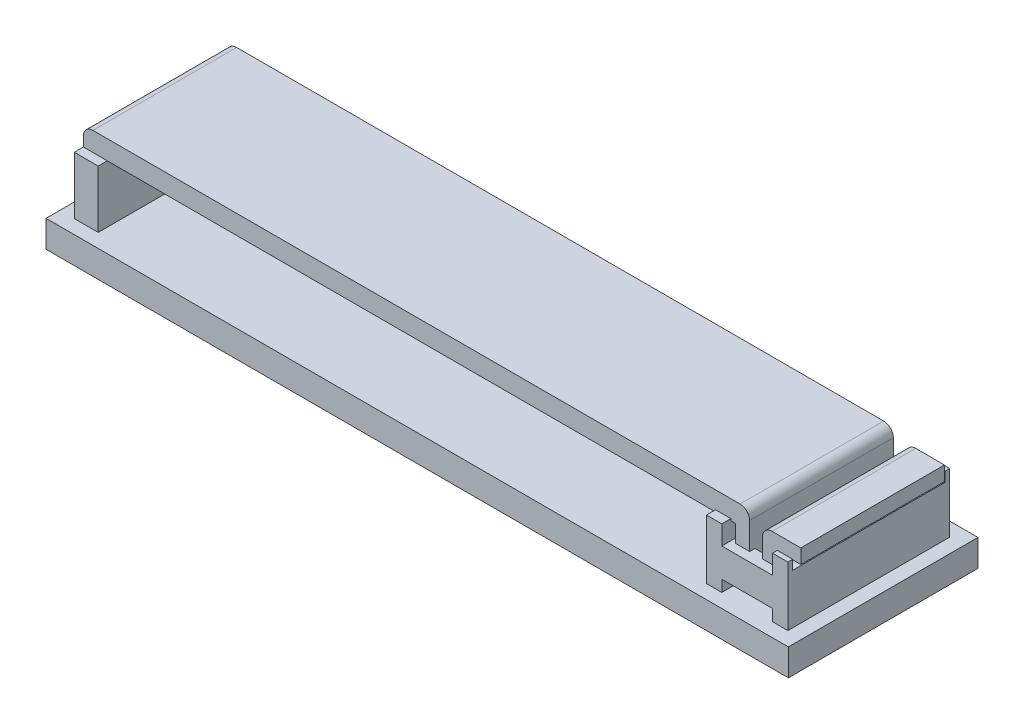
ISO-10303-21;
HEADER;
FILE_DESCRIPTION(('STEP AP214'),'2;1');
FILE_NAME('part.step','',(''),(''),'','','');
FILE_SCHEMA(('AUTOMOTIVE_DESIGN { 1 0 10303 214 1 1 1 1 }'));
ENDSEC;
DATA;
#1=APPLICATION_CONTEXT('core data for automotive mechanical design processes');
#2=APPLICATION_PROTOCOL_DEFINITION('international standard','automotive_design',2000,#1);
#3=PRODUCT_CONTEXT('',#1,'mechanical');
#4=PRODUCT('Part','Part','',(#3));
#5=PRODUCT_RELATED_PRODUCT_CATEGORY('part','',(#4));
#6=PRODUCT_DEFINITION_FORMATION('','',#4);
#7=PRODUCT_DEFINITION_CONTEXT('part definition',#1,'design');
#8=PRODUCT_DEFINITION('design','',#6,#7);
#9=PRODUCT_DEFINITION_SHAPE('','',#8);
#10=(LENGTH_UNIT() NAMED_UNIT(*) SI_UNIT(.MILLI.,.METRE.));
#11=(NAMED_UNIT(*) PLANE_ANGLE_UNIT() SI_UNIT($,.RADIAN.));
#12=(NAMED_UNIT(*) SI_UNIT($,.STERADIAN.) SOLID_ANGLE_UNIT());
#13=UNCERTAINTY_MEASURE_WITH_UNIT(LENGTH_MEASURE(1.E-05),#10,'distance_accuracy_value','');
#14=(GEOMETRIC_REPRESENTATION_CONTEXT(3) GLOBAL_UNCERTAINTY_ASSIGNED_CONTEXT((#13)) GLOBAL_UNIT_ASSIGNED_CONTEXT((#10,
#11,#12)) REPRESENTATION_CONTEXT('',''));
#15=CARTESIAN_POINT('',(0.,0.,0.));
#16=DIRECTION('',(0.,0.,1.));
#17=DIRECTION('',(1.,0.,0.));
#18=AXIS2_PLACEMENT_3D('',#15,#16,#17);
#19=CARTESIAN_POINT('',(30.35,7.,-9.901));
#20=DIRECTION('',(0.,-1.,0.));
#21=DIRECTION('',(0.,0.,-1.));
#22=AXIS2_PLACEMENT_3D('',#19,#20,#21);
#23=PLANE('',#22);
#24=DIRECTION('',(0.,0.,1.));
#25=VECTOR('',#24,1.);
#26=CARTESIAN_POINT('',(30.8082575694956,7.,-9.901));
#27=LINE('',#26,#25);
#28=CARTESIAN_POINT('',(30.8082575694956,7.,6.95));
#29=VERTEX_POINT('',#28);
#30=CARTESIAN_POINT('',(30.8082575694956,7.,7.5));
#31=VERTEX_POINT('',#30);
#32=EDGE_CURVE('E710',#29,#31,#27,.T.);
#33=ORIENTED_EDGE('',*,*,#32,.F.);
#34=DIRECTION('',(1.,0.,0.));
#35=VECTOR('',#34,1.);
#36=CARTESIAN_POINT('',(30.35,7.,6.95));
#37=LINE('',#36,#35);
#38=CARTESIAN_POINT('',(30.35,7.,6.95));
#39=VERTEX_POINT('',#38);
#40=EDGE_CURVE('E766',#39,#29,#37,.T.);
#41=ORIENTED_EDGE('',*,*,#40,.F.);
#42=DIRECTION('',(0.,0.,1.));
#43=VECTOR('',#42,1.);
#44=CARTESIAN_POINT('',(30.35,7.,-9.901));
#45=LINE('',#44,#43);
#46=CARTESIAN_POINT('',(30.35,7.,8.45));
#47=VERTEX_POINT('',#46);
#48=EDGE_CURVE('E829',#39,#47,#45,.T.);
#49=ORIENTED_EDGE('',*,*,#48,.T.);
#50=DIRECTION('',(1.,0.,0.));
#51=VECTOR('',#50,1.);
#52=CARTESIAN_POINT('',(30.35,7.,8.45));
#53=LINE('',#52,#51);
#54=CARTESIAN_POINT('',(35.65,7.,8.45));
#55=VERTEX_POINT('',#54);
#56=EDGE_CURVE('E823',#47,#55,#53,.T.);
#57=ORIENTED_EDGE('',*,*,#56,.T.);
#58=DIRECTION('',(0.,0.,1.));
#59=VECTOR('',#58,1.);
#60=CARTESIAN_POINT('',(35.65,7.,-9.901));
#61=LINE('',#60,#59);
#62=CARTESIAN_POINT('',(35.65,7.,6.95));
#63=VERTEX_POINT('',#62);
#64=EDGE_CURVE('E842',#63,#55,#61,.T.);
#65=ORIENTED_EDGE('',*,*,#64,.F.);
#66=CARTESIAN_POINT('',(35.15,7.,6.95));
#67=VERTEX_POINT('',#66);
#68=EDGE_CURVE('E765',#67,#63,#37,.T.);
#69=ORIENTED_EDGE('',*,*,#68,.F.);
#70=DIRECTION('',(0.,0.,-1.));
#71=VECTOR('',#70,1.);
#72=CARTESIAN_POINT('',(35.15,7.,-9.901));
#73=LINE('',#72,#71);
#74=CARTESIAN_POINT('',(35.15,7.,7.5));
#75=VERTEX_POINT('',#74);
#76=EDGE_CURVE('E702',#75,#67,#73,.T.);
#77=ORIENTED_EDGE('',*,*,#76,.F.);
#78=DIRECTION('',(1.,0.,0.));
#79=VECTOR('',#78,1.);
#80=CARTESIAN_POINT('',(30.35,7.,7.5));
#81=LINE('',#80,#79);
#82=CARTESIAN_POINT('',(33.65,7.,7.5));
#83=VERTEX_POINT('',#82);
#84=EDGE_CURVE('E732',#83,#75,#81,.T.);
#85=ORIENTED_EDGE('',*,*,#84,.F.);
#86=DIRECTION('',(0.,0.,1.));
#87=VECTOR('',#86,1.);
#88=CARTESIAN_POINT('',(33.65,7.,-9.901));
#89=LINE('',#88,#87);
#90=CARTESIAN_POINT('',(33.65,7.,6.95));
#91=VERTEX_POINT('',#90);
#92=EDGE_CURVE('E696',#91,#83,#89,.T.);
#93=ORIENTED_EDGE('',*,*,#92,.F.);
#94=CARTESIAN_POINT('',(32.3082575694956,7.,6.95));
#95=VERTEX_POINT('',#94);
#96=EDGE_CURVE('E770',#95,#91,#37,.T.);
#97=ORIENTED_EDGE('',*,*,#96,.F.);
#98=DIRECTION('',(0.,0.,-1.));
#99=VECTOR('',#98,1.);
#100=CARTESIAN_POINT('',(32.3082575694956,7.,-9.901));
#101=LINE('',#100,#99);
#102=CARTESIAN_POINT('',(32.3082575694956,7.,7.5));
#103=VERTEX_POINT('',#102);
#104=EDGE_CURVE('E684',#103,#95,#101,.T.);
#105=ORIENTED_EDGE('',*,*,#104,.F.);
#106=EDGE_CURVE('E734',#31,#103,#81,.T.);
#107=ORIENTED_EDGE('',*,*,#106,.F.);
#108=EDGE_LOOP('',(#33,#41,#49,#57,#65,#69,#77,#85,#93,#97,#105,#107));
#109=FACE_BOUND('',#108,.T.);
#110=ADVANCED_FACE('F34',(#109),#23,.F.);
#111=CARTESIAN_POINT('',(30.35,4.,-9.901));
#112=DIRECTION('',(0.,1.,0.));
#113=DIRECTION('',(0.,0.,1.));
#114=AXIS2_PLACEMENT_3D('',#111,#112,#113);
#115=PLANE('',#114);
#116=DIRECTION('',(-1.,0.,0.));
#117=VECTOR('',#116,1.);
#118=CARTESIAN_POINT('',(30.35,4.,6.95));
#119=LINE('',#118,#117);
#120=CARTESIAN_POINT('',(30.8543183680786,4.,6.95));
#121=VERTEX_POINT('',#120);
#122=CARTESIAN_POINT('',(30.35,4.,6.95));
#123=VERTEX_POINT('',#122);
#124=EDGE_CURVE('E49',#121,#123,#119,.T.);
#125=ORIENTED_EDGE('',*,*,#124,.F.);
#126=DIRECTION('',(0.,0.,-1.));
#127=VECTOR('',#126,1.);
#128=CARTESIAN_POINT('',(30.8543183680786,4.,6.95));
#129=LINE('',#128,#127);
#130=CARTESIAN_POINT('',(30.8543183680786,4.,7.5));
#131=VERTEX_POINT('',#130);
#132=EDGE_CURVE('E586',#121,#131,#129,.F.);
#133=ORIENTED_EDGE('',*,*,#132,.T.);
#134=DIRECTION('',(-1.,0.,0.));
#135=VECTOR('',#134,1.);
#136=CARTESIAN_POINT('',(30.35,4.,7.5));
#137=LINE('',#136,#135);
#138=CARTESIAN_POINT('',(35.1039392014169,4.,7.5));
#139=VERTEX_POINT('',#138);
#140=EDGE_CURVE('E729',#139,#131,#137,.T.);
#141=ORIENTED_EDGE('',*,*,#140,.F.);
#142=DIRECTION('',(0.,0.,-1.));
#143=VECTOR('',#142,1.);
#144=CARTESIAN_POINT('',(35.1039392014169,4.,7.5));
#145=LINE('',#144,#143);
#146=CARTESIAN_POINT('',(35.1039392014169,4.,6.95));
#147=VERTEX_POINT('',#146);
#148=EDGE_CURVE('E575',#139,#147,#145,.T.);
#149=ORIENTED_EDGE('',*,*,#148,.T.);
#150=CARTESIAN_POINT('',(35.65,4.,6.95));
#151=VERTEX_POINT('',#150);
#152=EDGE_CURVE('E785',#151,#147,#119,.T.);
#153=ORIENTED_EDGE('',*,*,#152,.F.);
#154=DIRECTION('',(0.,0.,1.));
#155=VECTOR('',#154,1.);
#156=CARTESIAN_POINT('',(35.65,4.,-9.901));
#157=LINE('',#156,#155);
#158=CARTESIAN_POINT('',(35.65,4.,8.45));
#159=VERTEX_POINT('',#158);
#160=EDGE_CURVE('E812',#151,#159,#157,.T.);
#161=ORIENTED_EDGE('',*,*,#160,.T.);
#162=DIRECTION('',(-1.,0.,0.));
#163=VECTOR('',#162,1.);
#164=CARTESIAN_POINT('',(30.35,4.,8.45));
#165=LINE('',#164,#163);
#166=CARTESIAN_POINT('',(30.35,4.,8.45));
#167=VERTEX_POINT('',#166);
#168=EDGE_CURVE('E800',#159,#167,#165,.T.);
#169=ORIENTED_EDGE('',*,*,#168,.T.);
#170=DIRECTION('',(0.,0.,1.));
#171=VECTOR('',#170,1.);
#172=CARTESIAN_POINT('',(30.35,4.,-9.901));
#173=LINE('',#172,#171);
#174=EDGE_CURVE('E808',#123,#167,#173,.T.);
#175=ORIENTED_EDGE('',*,*,#174,.F.);
#176=EDGE_LOOP('',(#125,#133,#141,#149,#153,#161,#169,#175));
#177=FACE_BOUND('',#176,.T.);
#178=ADVANCED_FACE('F947',(#177),#115,.F.);
#179=CARTESIAN_POINT('',(37.25,9.,8.45));
#180=DIRECTION('',(0.,-1.,0.));
#181=DIRECTION('',(1.,0.,0.));
#182=AXIS2_PLACEMENT_3D('',#179,#180,#181);
#183=PLANE('',#182);
#184=DIRECTION('',(1.,0.,0.));
#185=VECTOR('',#184,1.);
#186=CARTESIAN_POINT('',(37.25,9.,7.5));
#187=LINE('',#186,#185);
#188=CARTESIAN_POINT('',(28.75,9.,7.5));
#189=VERTEX_POINT('',#188);
#190=CARTESIAN_POINT('',(30.35,9.,7.5));
#191=VERTEX_POINT('',#190);
#192=EDGE_CURVE('E725',#189,#191,#187,.T.);
#193=ORIENTED_EDGE('',*,*,#192,.F.);
#194=DIRECTION('',(0.,0.,-1.));
#195=VECTOR('',#194,1.);
#196=CARTESIAN_POINT('',(28.75,9.,8.45));
#197=LINE('',#196,#195);
#198=CARTESIAN_POINT('',(28.75,9.,8.45));
#199=VERTEX_POINT('',#198);
#200=EDGE_CURVE('E878',#199,#189,#197,.T.);
#201=ORIENTED_EDGE('',*,*,#200,.F.);
#202=DIRECTION('',(-1.,0.,0.));
#203=VECTOR('',#202,1.);
#204=CARTESIAN_POINT('',(37.25,9.,8.45));
#205=LINE('',#204,#203);
#206=CARTESIAN_POINT('',(30.35,9.,8.45));
#207=VERTEX_POINT('',#206);
#208=EDGE_CURVE('E855',#207,#199,#205,.T.);
#209=ORIENTED_EDGE('',*,*,#208,.F.);
#210=DIRECTION('',(0.,0.,1.));
#211=VECTOR('',#210,1.);
#212=CARTESIAN_POINT('',(30.35,9.,-9.901));
#213=LINE('',#212,#211);
#214=EDGE_CURVE('E834',#191,#207,#213,.T.);
#215=ORIENTED_EDGE('',*,*,#214,.F.);
#216=EDGE_LOOP('',(#193,#201,#209,#215));
#217=FACE_BOUND('',#216,.T.);
#218=ADVANCED_FACE('F945',(#217),#183,.F.);
#219=CARTESIAN_POINT('',(-37.25,8.8,8.45));
#220=DIRECTION('',(0.,-1.,0.));
#221=DIRECTION('',(0.,0.,-1.));
#222=AXIS2_PLACEMENT_3D('',#219,#220,#221);
#223=PLANE('',#222);
#224=DIRECTION('',(1.,0.,0.));
#225=VECTOR('',#224,1.);
#226=CARTESIAN_POINT('',(-37.25,8.8,7.5));
#227=LINE('',#226,#225);
#228=CARTESIAN_POINT('',(-37.25,8.8,7.5));
#229=VERTEX_POINT('',#228);
#230=CARTESIAN_POINT('',(-34.75,8.8,7.5));
#231=VERTEX_POINT('',#230);
#232=EDGE_CURVE('E433',#229,#231,#227,.T.);
#233=ORIENTED_EDGE('',*,*,#232,.F.);
#234=DIRECTION('',(0.,0.,-1.));
#235=VECTOR('',#234,1.);
#236=CARTESIAN_POINT('',(-37.25,8.8,8.45));
#237=LINE('',#236,#235);
#238=CARTESIAN_POINT('',(-37.25,8.8,8.45));
#239=VERTEX_POINT('',#238);
#240=EDGE_CURVE('E450',#239,#229,#237,.T.);
#241=ORIENTED_EDGE('',*,*,#240,.F.);
#242=DIRECTION('',(-1.,0.,0.));
#243=VECTOR('',#242,1.);
#244=CARTESIAN_POINT('',(-37.25,8.8,8.45));
#245=LINE('',#244,#243);
#246=CARTESIAN_POINT('',(-34.75,8.8,8.45));
#247=VERTEX_POINT('',#246);
#248=EDGE_CURVE('E895',#247,#239,#245,.T.);
#249=ORIENTED_EDGE('',*,*,#248,.F.);
#250=DIRECTION('',(0.,0.,-1.));
#251=VECTOR('',#250,1.);
#252=CARTESIAN_POINT('',(-34.75,8.8,8.45));
#253=LINE('',#252,#251);
#254=EDGE_CURVE('E453',#247,#231,#253,.T.);
#255=ORIENTED_EDGE('',*,*,#254,.T.);
#256=EDGE_LOOP('',(#233,#241,#249,#255));
#257=FACE_BOUND('',#256,.T.);
#258=ADVANCED_FACE('F448',(#257),#223,.F.);
#259=CARTESIAN_POINT('',(28.75,2.8,8.45));
#260=DIRECTION('',(1.,0.,0.));
#261=DIRECTION('',(0.,0.,-1.));
#262=AXIS2_PLACEMENT_3D('',#259,#260,#261);
#263=PLANE('',#262);
#264=DIRECTION('',(0.,1.,0.));
#265=VECTOR('',#264,1.);
#266=CARTESIAN_POINT('',(28.75,2.8,7.5));
#267=LINE('',#266,#265);
#268=CARTESIAN_POINT('',(28.75,8.8,7.5));
#269=VERTEX_POINT('',#268);
#270=EDGE_CURVE('E727',#269,#189,#267,.T.);
#271=ORIENTED_EDGE('',*,*,#270,.F.);
#272=DIRECTION('',(0.,0.,1.));
#273=VECTOR('',#272,1.);
#274=CARTESIAN_POINT('',(28.75,8.8,8.45));
#275=LINE('',#274,#273);
#276=CARTESIAN_POINT('',(28.75,8.8,-7.5));
#277=VERTEX_POINT('',#276);
#278=EDGE_CURVE('E735',#277,#269,#275,.T.);
#279=ORIENTED_EDGE('',*,*,#278,.F.);
#280=DIRECTION('',(0.,1.,0.));
#281=VECTOR('',#280,1.);
#282=CARTESIAN_POINT('',(28.75,2.8,-7.5));
#283=LINE('',#282,#281);
#284=CARTESIAN_POINT('',(28.75,9.,-7.5));
#285=VERTEX_POINT('',#284);
#286=EDGE_CURVE('E722',#277,#285,#283,.T.);
#287=ORIENTED_EDGE('',*,*,#286,.T.);
#288=CARTESIAN_POINT('',(28.75,9.,-8.45));
#289=VERTEX_POINT('',#288);
#290=EDGE_CURVE('E877',#285,#289,#197,.T.);
#291=ORIENTED_EDGE('',*,*,#290,.T.);
#292=DIRECTION('',(0.,-1.,0.));
#293=VECTOR('',#292,1.);
#294=CARTESIAN_POINT('',(28.75,2.8,-8.45));
#295=LINE('',#294,#293);
#296=CARTESIAN_POINT('',(28.75,2.8,-8.45));
#297=VERTEX_POINT('',#296);
#298=EDGE_CURVE('E873',#289,#297,#295,.T.);
#299=ORIENTED_EDGE('',*,*,#298,.T.);
#300=DIRECTION('',(0.,0.,-1.));
#301=VECTOR('',#300,1.);
#302=CARTESIAN_POINT('',(28.75,2.8,8.45));
#303=LINE('',#302,#301);
#304=CARTESIAN_POINT('',(28.75,2.8,8.45));
#305=VERTEX_POINT('',#304);
#306=EDGE_CURVE('E862',#305,#297,#303,.T.);
#307=ORIENTED_EDGE('',*,*,#306,.F.);
#308=DIRECTION('',(0.,-1.,0.));
#309=VECTOR('',#308,1.);
#310=CARTESIAN_POINT('',(28.75,2.8,8.45));
#311=LINE('',#310,#309);
#312=EDGE_CURVE('E859',#199,#305,#311,.T.);
#313=ORIENTED_EDGE('',*,*,#312,.F.);
#314=ORIENTED_EDGE('',*,*,#200,.T.);
#315=EDGE_LOOP('',(#271,#279,#287,#291,#299,#307,#313,#314));
#316=FACE_BOUND('',#315,.T.);
#317=ADVANCED_FACE('F944',(#316),#263,.F.);
#318=CARTESIAN_POINT('',(30.35,9.,-9.901));
#319=DIRECTION('',(-1.,0.,0.));
#320=DIRECTION('',(0.,0.,1.));
#321=AXIS2_PLACEMENT_3D('',#318,#319,#320);
#322=PLANE('',#321);
#323=DIRECTION('',(0.,-1.,0.));
#324=VECTOR('',#323,1.);
#325=CARTESIAN_POINT('',(30.35,9.,7.5));
#326=LINE('',#325,#324);
#327=CARTESIAN_POINT('',(30.35,8.8,7.5));
#328=VERTEX_POINT('',#327);
#329=EDGE_CURVE('E520',#191,#328,#326,.T.);
#330=ORIENTED_EDGE('',*,*,#329,.F.);
#331=ORIENTED_EDGE('',*,*,#214,.T.);
#332=DIRECTION('',(0.,-1.,0.));
#333=VECTOR('',#332,1.);
#334=CARTESIAN_POINT('',(30.35,9.,8.45));
#335=LINE('',#334,#333);
#336=EDGE_CURVE('E820',#207,#47,#335,.T.);
#337=ORIENTED_EDGE('',*,*,#336,.T.);
#338=ORIENTED_EDGE('',*,*,#48,.F.);
#339=DIRECTION('',(0.,1.,0.));
#340=VECTOR('',#339,1.);
#341=CARTESIAN_POINT('',(30.35,-0.00100000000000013,6.95));
#342=LINE('',#341,#340);
#343=EDGE_CURVE('E774',#123,#39,#342,.T.);
#344=ORIENTED_EDGE('',*,*,#343,.F.);
#345=ORIENTED_EDGE('',*,*,#174,.T.);
#346=DIRECTION('',(0.,-1.,0.));
#347=VECTOR('',#346,1.);
#348=CARTESIAN_POINT('',(30.35,2.8,8.45));
#349=LINE('',#348,#347);
#350=CARTESIAN_POINT('',(30.35,2.8,8.45));
#351=VERTEX_POINT('',#350);
#352=EDGE_CURVE('E795',#167,#351,#349,.T.);
#353=ORIENTED_EDGE('',*,*,#352,.T.);
#354=DIRECTION('',(0.,0.,1.));
#355=VECTOR('',#354,1.);
#356=CARTESIAN_POINT('',(30.35,2.8,-9.901));
#357=LINE('',#356,#355);
#358=CARTESIAN_POINT('',(30.35,2.8,-8.45));
#359=VERTEX_POINT('',#358);
#360=EDGE_CURVE('E803',#359,#351,#357,.T.);
#361=ORIENTED_EDGE('',*,*,#360,.F.);
#362=DIRECTION('',(0.,1.,0.));
#363=VECTOR('',#362,1.);
#364=CARTESIAN_POINT('',(30.35,2.8,-8.45));
#365=LINE('',#364,#363);
#366=CARTESIAN_POINT('',(30.35,4.,-8.45));
#367=VERTEX_POINT('',#366);
#368=EDGE_CURVE('E792',#359,#367,#365,.T.);
#369=ORIENTED_EDGE('',*,*,#368,.T.);
#370=CARTESIAN_POINT('',(30.35,4.,-6.95));
#371=VERTEX_POINT('',#370);
#372=EDGE_CURVE('E804',#367,#371,#173,.T.);
#373=ORIENTED_EDGE('',*,*,#372,.T.);
#374=DIRECTION('',(0.,1.,0.));
#375=VECTOR('',#374,1.);
#376=CARTESIAN_POINT('',(30.35,-0.00100000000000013,-6.95));
#377=LINE('',#376,#375);
#378=CARTESIAN_POINT('',(30.35,7.,-6.95));
#379=VERTEX_POINT('',#378);
#380=EDGE_CURVE('E776',#371,#379,#377,.T.);
#381=ORIENTED_EDGE('',*,*,#380,.T.);
#382=CARTESIAN_POINT('',(30.35,7.,-8.45));
#383=VERTEX_POINT('',#382);
#384=EDGE_CURVE('E843',#383,#379,#45,.T.);
#385=ORIENTED_EDGE('',*,*,#384,.F.);
#386=DIRECTION('',(0.,1.,0.));
#387=VECTOR('',#386,1.);
#388=CARTESIAN_POINT('',(30.35,9.,-8.45));
#389=LINE('',#388,#387);
#390=CARTESIAN_POINT('',(30.35,9.,-8.45));
#391=VERTEX_POINT('',#390);
#392=EDGE_CURVE('E818',#383,#391,#389,.T.);
#393=ORIENTED_EDGE('',*,*,#392,.T.);
#394=CARTESIAN_POINT('',(30.35,9.,-7.5));
#395=VERTEX_POINT('',#394);
#396=EDGE_CURVE('E830',#391,#395,#213,.T.);
#397=ORIENTED_EDGE('',*,*,#396,.T.);
#398=DIRECTION('',(0.,-1.,0.));
#399=VECTOR('',#398,1.);
#400=CARTESIAN_POINT('',(30.35,9.,-7.5));
#401=LINE('',#400,#399);
#402=CARTESIAN_POINT('',(30.35,8.8,-7.5));
#403=VERTEX_POINT('',#402);
#404=EDGE_CURVE('E716',#395,#403,#401,.T.);
#405=ORIENTED_EDGE('',*,*,#404,.T.);
#406=DIRECTION('',(0.,0.,-1.));
#407=VECTOR('',#406,1.);
#408=CARTESIAN_POINT('',(30.35,8.8,-9.901));
#409=LINE('',#408,#407);
#410=EDGE_CURVE('E517',#328,#403,#409,.T.);
#411=ORIENTED_EDGE('',*,*,#410,.F.);
#412=EDGE_LOOP('',(#330,#331,#337,#338,#344,#345,#353,#361,#369,#373,#381,#385,#393,#397,#405,#411));
#413=FACE_BOUND('',#412,.T.);
#414=ADVANCED_FACE('F960',(#413),#322,.F.);
#415=DIRECTION('',(0.,0.,1.));
#416=VECTOR('',#415,1.);
#417=CARTESIAN_POINT('',(30.8082575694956,7.,-9.901));
#418=LINE('',#417,#416);
#419=CARTESIAN_POINT('',(30.8082575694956,7.,-7.5));
#420=VERTEX_POINT('',#419);
#421=CARTESIAN_POINT('',(30.8082575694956,7.,-6.95));
#422=VERTEX_POINT('',#421);
#423=EDGE_CURVE('E705',#420,#422,#418,.T.);
#424=ORIENTED_EDGE('',*,*,#423,.F.);
#425=DIRECTION('',(1.,0.,0.));
#426=VECTOR('',#425,1.);
#427=CARTESIAN_POINT('',(30.35,7.,-7.5));
#428=LINE('',#427,#426);
#429=CARTESIAN_POINT('',(32.3082575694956,7.,-7.5));
#430=VERTEX_POINT('',#429);
#431=EDGE_CURVE('E715',#420,#430,#428,.T.);
#432=ORIENTED_EDGE('',*,*,#431,.T.);
#433=DIRECTION('',(0.,0.,-1.));
#434=VECTOR('',#433,1.);
#435=CARTESIAN_POINT('',(32.3082575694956,7.,-9.901));
#436=LINE('',#435,#434);
#437=CARTESIAN_POINT('',(32.3082575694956,7.,-6.95));
#438=VERTEX_POINT('',#437);
#439=EDGE_CURVE('E678',#438,#430,#436,.T.);
#440=ORIENTED_EDGE('',*,*,#439,.F.);
#441=DIRECTION('',(-1.,0.,0.));
#442=VECTOR('',#441,1.);
#443=CARTESIAN_POINT('',(30.35,7.,-6.95));
#444=LINE('',#443,#442);
#445=CARTESIAN_POINT('',(33.65,7.,-6.95));
#446=VERTEX_POINT('',#445);
#447=EDGE_CURVE('E775',#446,#438,#444,.T.);
#448=ORIENTED_EDGE('',*,*,#447,.F.);
#449=DIRECTION('',(0.,0.,1.));
#450=VECTOR('',#449,1.);
#451=CARTESIAN_POINT('',(33.65,7.,-9.901));
#452=LINE('',#451,#450);
#453=CARTESIAN_POINT('',(33.65,7.,-7.5));
#454=VERTEX_POINT('',#453);
#455=EDGE_CURVE('E690',#454,#446,#452,.T.);
#456=ORIENTED_EDGE('',*,*,#455,.F.);
#457=CARTESIAN_POINT('',(35.15,7.,-7.5));
#458=VERTEX_POINT('',#457);
#459=EDGE_CURVE('E713',#454,#458,#428,.T.);
#460=ORIENTED_EDGE('',*,*,#459,.T.);
#461=DIRECTION('',(0.,0.,-1.));
#462=VECTOR('',#461,1.);
#463=CARTESIAN_POINT('',(35.15,7.,-9.901));
#464=LINE('',#463,#462);
#465=CARTESIAN_POINT('',(35.15,7.,-6.95));
#466=VERTEX_POINT('',#465);
#467=EDGE_CURVE('E607',#466,#458,#464,.T.);
#468=ORIENTED_EDGE('',*,*,#467,.F.);
#469=CARTESIAN_POINT('',(35.65,7.,-6.95));
#470=VERTEX_POINT('',#469);
#471=EDGE_CURVE('E771',#470,#466,#444,.T.);
#472=ORIENTED_EDGE('',*,*,#471,.F.);
#473=CARTESIAN_POINT('',(35.65,7.,-8.45));
#474=VERTEX_POINT('',#473);
#475=EDGE_CURVE('E839',#474,#470,#61,.T.);
#476=ORIENTED_EDGE('',*,*,#475,.F.);
#477=DIRECTION('',(-1.,0.,0.));
#478=VECTOR('',#477,1.);
#479=CARTESIAN_POINT('',(30.35,7.,-8.45));
#480=LINE('',#479,#478);
#481=EDGE_CURVE('E833',#474,#383,#480,.T.);
#482=ORIENTED_EDGE('',*,*,#481,.T.);
#483=ORIENTED_EDGE('',*,*,#384,.T.);
#484=EDGE_CURVE('E769',#422,#379,#444,.T.);
#485=ORIENTED_EDGE('',*,*,#484,.F.);
#486=EDGE_LOOP('',(#424,#432,#440,#448,#456,#460,#468,#472,#476,#482,#483,#485));
#487=FACE_BOUND('',#486,.T.);
#488=ADVANCED_FACE('F950',(#487),#23,.F.);
#489=DIRECTION('',(-1.,0.,0.));
#490=VECTOR('',#489,1.);
#491=CARTESIAN_POINT('',(30.35,4.,-7.5));
#492=LINE('',#491,#490);
#493=CARTESIAN_POINT('',(35.1039392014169,4.,-7.5));
#494=VERTEX_POINT('',#493);
#495=CARTESIAN_POINT('',(30.8543183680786,4.,-7.5));
#496=VERTEX_POINT('',#495);
#497=EDGE_CURVE('E514',#494,#496,#492,.T.);
#498=ORIENTED_EDGE('',*,*,#497,.T.);
#499=DIRECTION('',(0.,0.,-1.));
#500=VECTOR('',#499,1.);
#501=CARTESIAN_POINT('',(30.8543183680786,4.,-7.5));
#502=LINE('',#501,#500);
#503=CARTESIAN_POINT('',(30.8543183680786,4.,-6.95));
#504=VERTEX_POINT('',#503);
#505=EDGE_CURVE('E580',#496,#504,#502,.F.);
#506=ORIENTED_EDGE('',*,*,#505,.T.);
#507=DIRECTION('',(1.,0.,0.));
#508=VECTOR('',#507,1.);
#509=CARTESIAN_POINT('',(30.35,4.,-6.95));
#510=LINE('',#509,#508);
#511=EDGE_CURVE('E57',#371,#504,#510,.T.);
#512=ORIENTED_EDGE('',*,*,#511,.F.);
#513=ORIENTED_EDGE('',*,*,#372,.F.);
#514=DIRECTION('',(1.,0.,0.));
#515=VECTOR('',#514,1.);
#516=CARTESIAN_POINT('',(30.35,4.,-8.45));
#517=LINE('',#516,#515);
#518=CARTESIAN_POINT('',(35.65,4.,-8.45));
#519=VERTEX_POINT('',#518);
#520=EDGE_CURVE('E789',#367,#519,#517,.T.);
#521=ORIENTED_EDGE('',*,*,#520,.T.);
#522=CARTESIAN_POINT('',(35.65,4.,-6.95));
#523=VERTEX_POINT('',#522);
#524=EDGE_CURVE('E809',#519,#523,#157,.T.);
#525=ORIENTED_EDGE('',*,*,#524,.T.);
#526=CARTESIAN_POINT('',(35.1039392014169,4.,-6.95));
#527=VERTEX_POINT('',#526);
#528=EDGE_CURVE('E763',#527,#523,#510,.T.);
#529=ORIENTED_EDGE('',*,*,#528,.F.);
#530=DIRECTION('',(0.,0.,-1.));
#531=VECTOR('',#530,1.);
#532=CARTESIAN_POINT('',(35.1039392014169,4.,-6.95));
#533=LINE('',#532,#531);
#534=EDGE_CURVE('E573',#527,#494,#533,.T.);
#535=ORIENTED_EDGE('',*,*,#534,.T.);
#536=EDGE_LOOP('',(#498,#506,#512,#513,#521,#525,#529,#535));
#537=FACE_BOUND('',#536,.T.);
#538=ADVANCED_FACE('F955',(#537),#115,.F.);
#539=CARTESIAN_POINT('',(30.35,-0.00100000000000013,6.95));
#540=DIRECTION('',(0.,0.,1.));
#541=DIRECTION('',(1.,0.,0.));
#542=AXIS2_PLACEMENT_3D('',#539,#540,#541);
#543=PLANE('',#542);
#544=DIRECTION('',(0.,1.,0.));
#545=VECTOR('',#544,1.);
#546=CARTESIAN_POINT('',(30.8082575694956,-0.00100000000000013,6.95));
#547=LINE('',#546,#545);
#548=CARTESIAN_POINT('',(30.8082575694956,4.3,6.95));
#549=VERTEX_POINT('',#548);
#550=EDGE_CURVE('E708',#549,#29,#547,.T.);
#551=ORIENTED_EDGE('',*,*,#550,.F.);
#552=CARTESIAN_POINT('',(31.8082575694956,4.3,6.95));
#553=DIRECTION('',(0.,0.,1.));
#554=DIRECTION('',(1.,0.,0.));
#555=AXIS2_PLACEMENT_3D('',#552,#553,#554);
#556=CIRCLE('',#555,1.);
#557=EDGE_CURVE('E584',#549,#121,#556,.T.);
#558=ORIENTED_EDGE('',*,*,#557,.T.);
#559=ORIENTED_EDGE('',*,*,#124,.T.);
#560=ORIENTED_EDGE('',*,*,#343,.T.);
#561=ORIENTED_EDGE('',*,*,#40,.T.);
#562=EDGE_LOOP('',(#551,#558,#559,#560,#561));
#563=FACE_BOUND('',#562,.T.);
#564=ADVANCED_FACE('F966',(#563),#543,.F.);
#565=DIRECTION('',(0.,-1.,0.));
#566=VECTOR('',#565,1.);
#567=CARTESIAN_POINT('',(35.15,-0.00100000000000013,6.95));
#568=LINE('',#567,#566);
#569=CARTESIAN_POINT('',(35.15,4.3,6.95));
#570=VERTEX_POINT('',#569);
#571=EDGE_CURVE('E700',#67,#570,#568,.T.);
#572=ORIENTED_EDGE('',*,*,#571,.F.);
#573=ORIENTED_EDGE('',*,*,#68,.T.);
#574=DIRECTION('',(0.,1.,0.));
#575=VECTOR('',#574,1.);
#576=CARTESIAN_POINT('',(35.65,-0.00100000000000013,6.95));
#577=LINE('',#576,#575);
#578=EDGE_CURVE('E781',#151,#63,#577,.T.);
#579=ORIENTED_EDGE('',*,*,#578,.F.);
#580=ORIENTED_EDGE('',*,*,#152,.T.);
#581=CARTESIAN_POINT('',(34.15,4.3,6.95));
#582=DIRECTION('',(0.,0.,1.));
#583=DIRECTION('',(1.,0.,0.));
#584=AXIS2_PLACEMENT_3D('',#581,#582,#583);
#585=CIRCLE('',#584,1.);
#586=EDGE_CURVE('E578',#147,#570,#585,.T.);
#587=ORIENTED_EDGE('',*,*,#586,.T.);
#588=EDGE_LOOP('',(#572,#573,#579,#580,#587));
#589=FACE_BOUND('',#588,.T.);
#590=ADVANCED_FACE('F1096',(#589),#543,.F.);
#591=DIRECTION('',(0.,1.,0.));
#592=VECTOR('',#591,1.);
#593=CARTESIAN_POINT('',(33.65,-0.00100000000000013,6.95));
#594=LINE('',#593,#592);
#595=CARTESIAN_POINT('',(33.65,4.8,6.95));
#596=VERTEX_POINT('',#595);
#597=EDGE_CURVE('E693',#596,#91,#594,.T.);
#598=ORIENTED_EDGE('',*,*,#597,.F.);
#599=DIRECTION('',(1.,0.,0.));
#600=VECTOR('',#599,1.);
#601=CARTESIAN_POINT('',(30.35,4.8,6.95));
#602=LINE('',#601,#600);
#603=CARTESIAN_POINT('',(32.3082575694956,4.8,6.95));
#604=VERTEX_POINT('',#603);
#605=EDGE_CURVE('E687',#604,#596,#602,.T.);
#606=ORIENTED_EDGE('',*,*,#605,.F.);
#607=DIRECTION('',(0.,-1.,0.));
#608=VECTOR('',#607,1.);
#609=CARTESIAN_POINT('',(32.3082575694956,-0.00100000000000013,6.95));
#610=LINE('',#609,#608);
#611=EDGE_CURVE('E681',#95,#604,#610,.T.);
#612=ORIENTED_EDGE('',*,*,#611,.F.);
#613=ORIENTED_EDGE('',*,*,#96,.T.);
#614=EDGE_LOOP('',(#598,#606,#612,#613));
#615=FACE_BOUND('',#614,.T.);
#616=ADVANCED_FACE('F1093',(#615),#543,.F.);
#617=CARTESIAN_POINT('',(30.35,-0.00100000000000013,-6.95));
#618=DIRECTION('',(0.,0.,-1.));
#619=DIRECTION('',(-1.,0.,0.));
#620=AXIS2_PLACEMENT_3D('',#617,#618,#619);
#621=PLANE('',#620);
#622=DIRECTION('',(0.,-1.,0.));
#623=VECTOR('',#622,1.);
#624=CARTESIAN_POINT('',(30.8082575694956,-0.00100000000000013,-6.95));
#625=LINE('',#624,#623);
#626=CARTESIAN_POINT('',(30.8082575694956,4.3,-6.95));
#627=VERTEX_POINT('',#626);
#628=EDGE_CURVE('E511',#422,#627,#625,.T.);
#629=ORIENTED_EDGE('',*,*,#628,.F.);
#630=ORIENTED_EDGE('',*,*,#484,.T.);
#631=ORIENTED_EDGE('',*,*,#380,.F.);
#632=ORIENTED_EDGE('',*,*,#511,.T.);
#633=CARTESIAN_POINT('',(31.8082575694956,4.3,-6.95));
#634=DIRECTION('',(0.,0.,-1.));
#635=DIRECTION('',(-1.,0.,0.));
#636=AXIS2_PLACEMENT_3D('',#633,#634,#635);
#637=CIRCLE('',#636,1.);
#638=EDGE_CURVE('E582',#504,#627,#637,.T.);
#639=ORIENTED_EDGE('',*,*,#638,.T.);
#640=EDGE_LOOP('',(#629,#630,#631,#632,#639));
#641=FACE_BOUND('',#640,.T.);
#642=ADVANCED_FACE('F1090',(#641),#621,.F.);
#643=DIRECTION('',(0.,1.,0.));
#644=VECTOR('',#643,1.);
#645=CARTESIAN_POINT('',(35.15,-0.00100000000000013,-6.95));
#646=LINE('',#645,#644);
#647=CARTESIAN_POINT('',(35.15,4.3,-6.95));
#648=VERTEX_POINT('',#647);
#649=EDGE_CURVE('E509',#648,#466,#646,.T.);
#650=ORIENTED_EDGE('',*,*,#649,.F.);
#651=CARTESIAN_POINT('',(34.15,4.3,-6.95));
#652=DIRECTION('',(0.,0.,-1.));
#653=DIRECTION('',(-1.,0.,0.));
#654=AXIS2_PLACEMENT_3D('',#651,#652,#653);
#655=CIRCLE('',#654,1.);
#656=EDGE_CURVE('E570',#648,#527,#655,.T.);
#657=ORIENTED_EDGE('',*,*,#656,.T.);
#658=ORIENTED_EDGE('',*,*,#528,.T.);
#659=DIRECTION('',(0.,1.,0.));
#660=VECTOR('',#659,1.);
#661=CARTESIAN_POINT('',(35.65,-0.00100000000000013,-6.95));
#662=LINE('',#661,#660);
#663=EDGE_CURVE('E779',#523,#470,#662,.T.);
#664=ORIENTED_EDGE('',*,*,#663,.T.);
#665=ORIENTED_EDGE('',*,*,#471,.T.);
#666=EDGE_LOOP('',(#650,#657,#658,#664,#665));
#667=FACE_BOUND('',#666,.T.);
#668=ADVANCED_FACE('F1037',(#667),#621,.F.);
#669=DIRECTION('',(0.,-1.,0.));
#670=VECTOR('',#669,1.);
#671=CARTESIAN_POINT('',(33.65,-0.00100000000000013,-6.95));
#672=LINE('',#671,#670);
#673=CARTESIAN_POINT('',(33.65,4.8,-6.95));
#674=VERTEX_POINT('',#673);
#675=EDGE_CURVE('E506',#446,#674,#672,.T.);
#676=ORIENTED_EDGE('',*,*,#675,.F.);
#677=ORIENTED_EDGE('',*,*,#447,.T.);
#678=DIRECTION('',(0.,1.,0.));
#679=VECTOR('',#678,1.);
#680=CARTESIAN_POINT('',(32.3082575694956,-0.00100000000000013,-6.95));
#681=LINE('',#680,#679);
#682=CARTESIAN_POINT('',(32.3082575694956,4.8,-6.95));
#683=VERTEX_POINT('',#682);
#684=EDGE_CURVE('E500',#683,#438,#681,.T.);
#685=ORIENTED_EDGE('',*,*,#684,.F.);
#686=DIRECTION('',(-1.,0.,0.));
#687=VECTOR('',#686,1.);
#688=CARTESIAN_POINT('',(30.35,4.8,-6.95));
#689=LINE('',#688,#687);
#690=EDGE_CURVE('E503',#674,#683,#689,.T.);
#691=ORIENTED_EDGE('',*,*,#690,.F.);
#692=EDGE_LOOP('',(#676,#677,#685,#691));
#693=FACE_BOUND('',#692,.T.);
#694=ADVANCED_FACE('F1094',(#693),#621,.F.);
#695=DIRECTION('',(0.,0.,1.));
#696=VECTOR('',#695,1.);
#697=CARTESIAN_POINT('',(35.65,9.,-9.901));
#698=LINE('',#697,#696);
#699=CARTESIAN_POINT('',(35.65,9.,-8.45));
#700=VERTEX_POINT('',#699);
#701=CARTESIAN_POINT('',(35.65,9.,-7.95));
#702=VERTEX_POINT('',#701);
#703=EDGE_CURVE('E835',#700,#702,#698,.T.);
#704=ORIENTED_EDGE('',*,*,#703,.T.);
#705=DIRECTION('',(1.,0.,0.));
#706=VECTOR('',#705,1.);
#707=CARTESIAN_POINT('',(-38.751,9.,-7.95));
#708=LINE('',#707,#706);
#709=CARTESIAN_POINT('',(37.25,9.,-7.95));
#710=VERTEX_POINT('',#709);
#711=EDGE_CURVE('E758',#702,#710,#708,.T.);
#712=ORIENTED_EDGE('',*,*,#711,.T.);
#713=DIRECTION('',(0.,0.,-1.));
#714=VECTOR('',#713,1.);
#715=CARTESIAN_POINT('',(37.25,9.,8.45));
#716=LINE('',#715,#714);
#717=CARTESIAN_POINT('',(37.25,9.,-8.45));
#718=VERTEX_POINT('',#717);
#719=EDGE_CURVE('E881',#710,#718,#716,.T.);
#720=ORIENTED_EDGE('',*,*,#719,.T.);
#721=DIRECTION('',(-1.,0.,0.));
#722=VECTOR('',#721,1.);
#723=CARTESIAN_POINT('',(37.25,9.,-8.45));
#724=LINE('',#723,#722);
#725=EDGE_CURVE('E870',#718,#700,#724,.T.);
#726=ORIENTED_EDGE('',*,*,#725,.T.);
#727=EDGE_LOOP('',(#704,#712,#720,#726));
#728=FACE_BOUND('',#727,.T.);
#729=ADVANCED_FACE('F1119',(#728),#183,.F.);
#730=ORIENTED_EDGE('',*,*,#290,.F.);
#731=DIRECTION('',(1.,0.,0.));
#732=VECTOR('',#731,1.);
#733=CARTESIAN_POINT('',(37.25,9.,-7.5));
#734=LINE('',#733,#732);
#735=EDGE_CURVE('E719',#285,#395,#734,.T.);
#736=ORIENTED_EDGE('',*,*,#735,.T.);
#737=ORIENTED_EDGE('',*,*,#396,.F.);
#738=EDGE_CURVE('E869',#391,#289,#724,.T.);
#739=ORIENTED_EDGE('',*,*,#738,.T.);
#740=EDGE_LOOP('',(#730,#736,#737,#739));
#741=FACE_BOUND('',#740,.T.);
#742=ADVANCED_FACE('F986',(#741),#183,.F.);
#743=CARTESIAN_POINT('',(-38.75,2.8,-9.9));
#744=DIRECTION('',(0.,-1.,0.));
#745=DIRECTION('',(0.,0.,-1.));
#746=AXIS2_PLACEMENT_3D('',#743,#744,#745);
#747=PLANE('',#746);
#748=DIRECTION('',(1.,0.,0.));
#749=VECTOR('',#748,1.);
#750=CARTESIAN_POINT('',(28.75,2.8,8.45));
#751=LINE('',#750,#749);
#752=CARTESIAN_POINT('',(35.65,2.8,8.45));
#753=VERTEX_POINT('',#752);
#754=CARTESIAN_POINT('',(37.25,2.8,8.45));
#755=VERTEX_POINT('',#754);
#756=EDGE_CURVE('E853',#753,#755,#751,.T.);
#757=ORIENTED_EDGE('',*,*,#756,.F.);
#758=DIRECTION('',(0.,0.,1.));
#759=VECTOR('',#758,1.);
#760=CARTESIAN_POINT('',(35.65,2.8,-9.901));
#761=LINE('',#760,#759);
#762=CARTESIAN_POINT('',(35.65,2.8,-8.45));
#763=VERTEX_POINT('',#762);
#764=EDGE_CURVE('E813',#763,#753,#761,.T.);
#765=ORIENTED_EDGE('',*,*,#764,.F.);
#766=DIRECTION('',(1.,0.,0.));
#767=VECTOR('',#766,1.);
#768=CARTESIAN_POINT('',(28.75,2.8,-8.45));
#769=LINE('',#768,#767);
#770=CARTESIAN_POINT('',(37.25,2.8,-8.45));
#771=VERTEX_POINT('',#770);
#772=EDGE_CURVE('E848',#763,#771,#769,.T.);
#773=ORIENTED_EDGE('',*,*,#772,.T.);
#774=DIRECTION('',(0.,0.,-1.));
#775=VECTOR('',#774,1.);
#776=CARTESIAN_POINT('',(37.25,2.8,8.45));
#777=LINE('',#776,#775);
#778=EDGE_CURVE('E885',#755,#771,#777,.T.);
#779=ORIENTED_EDGE('',*,*,#778,.F.);
#780=EDGE_LOOP('',(#757,#765,#773,#779));
#781=FACE_BOUND('',#780,.T.);
#782=ORIENTED_EDGE('',*,*,#360,.T.);
#783=EDGE_CURVE('E849',#305,#351,#751,.T.);
#784=ORIENTED_EDGE('',*,*,#783,.F.);
#785=ORIENTED_EDGE('',*,*,#306,.T.);
#786=EDGE_CURVE('E863',#297,#359,#769,.T.);
#787=ORIENTED_EDGE('',*,*,#786,.T.);
#788=EDGE_LOOP('',(#782,#784,#785,#787));
#789=FACE_BOUND('',#788,.T.);
#790=DIRECTION('',(0.,0.,1.));
#791=VECTOR('',#790,1.);
#792=CARTESIAN_POINT('',(-38.75,2.8,9.9));
#793=LINE('',#792,#791);
#794=CARTESIAN_POINT('',(-38.75,2.8,-9.9));
#795=VERTEX_POINT('',#794);
#796=CARTESIAN_POINT('',(-38.75,2.8,9.9));
#797=VERTEX_POINT('',#796);
#798=EDGE_CURVE('E471',#795,#797,#793,.T.);
#799=ORIENTED_EDGE('',*,*,#798,.T.);
#800=DIRECTION('',(1.,0.,0.));
#801=VECTOR('',#800,1.);
#802=CARTESIAN_POINT('',(-38.75,2.8,9.9));
#803=LINE('',#802,#801);
#804=CARTESIAN_POINT('',(38.75,2.8,9.9));
#805=VERTEX_POINT('',#804);
#806=EDGE_CURVE('E474',#797,#805,#803,.T.);
#807=ORIENTED_EDGE('',*,*,#806,.T.);
#808=DIRECTION('',(0.,0.,-1.));
#809=VECTOR('',#808,1.);
#810=CARTESIAN_POINT('',(38.75,2.8,9.9));
#811=LINE('',#810,#809);
#812=CARTESIAN_POINT('',(38.75,2.8,-9.9));
#813=VERTEX_POINT('',#812);
#814=EDGE_CURVE('E477',#805,#813,#811,.T.);
#815=ORIENTED_EDGE('',*,*,#814,.T.);
#816=DIRECTION('',(-1.,0.,0.));
#817=VECTOR('',#816,1.);
#818=CARTESIAN_POINT('',(-38.75,2.8,-9.9));
#819=LINE('',#818,#817);
#820=EDGE_CURVE('E479',#813,#795,#819,.T.);
#821=ORIENTED_EDGE('',*,*,#820,.T.);
#822=EDGE_LOOP('',(#799,#807,#815,#821));
#823=FACE_BOUND('',#822,.T.);
#824=DIRECTION('',(1.,0.,0.));
#825=VECTOR('',#824,1.);
#826=CARTESIAN_POINT('',(-37.25,2.8,8.45));
#827=LINE('',#826,#825);
#828=CARTESIAN_POINT('',(-37.25,2.8,8.45));
#829=VERTEX_POINT('',#828);
#830=CARTESIAN_POINT('',(-34.75,2.8,8.45));
#831=VERTEX_POINT('',#830);
#832=EDGE_CURVE('E889',#829,#831,#827,.T.);
#833=ORIENTED_EDGE('',*,*,#832,.F.);
#834=DIRECTION('',(0.,0.,-1.));
#835=VECTOR('',#834,1.);
#836=CARTESIAN_POINT('',(-37.25,2.8,8.45));
#837=LINE('',#836,#835);
#838=CARTESIAN_POINT('',(-37.25,2.8,-8.45));
#839=VERTEX_POINT('',#838);
#840=EDGE_CURVE('E464',#829,#839,#837,.T.);
#841=ORIENTED_EDGE('',*,*,#840,.T.);
#842=DIRECTION('',(1.,0.,0.));
#843=VECTOR('',#842,1.);
#844=CARTESIAN_POINT('',(-37.25,2.8,-8.45));
#845=LINE('',#844,#843);
#846=CARTESIAN_POINT('',(-34.75,2.8,-8.45));
#847=VERTEX_POINT('',#846);
#848=EDGE_CURVE('E888',#839,#847,#845,.T.);
#849=ORIENTED_EDGE('',*,*,#848,.T.);
#850=DIRECTION('',(0.,0.,-1.));
#851=VECTOR('',#850,1.);
#852=CARTESIAN_POINT('',(-34.75,2.8,8.45));
#853=LINE('',#852,#851);
#854=EDGE_CURVE('E468',#831,#847,#853,.T.);
#855=ORIENTED_EDGE('',*,*,#854,.F.);
#856=EDGE_LOOP('',(#833,#841,#849,#855));
#857=FACE_BOUND('',#856,.T.);
#858=ADVANCED_FACE('F916',(#781,#789,#823,#857),#747,.F.);
#859=CARTESIAN_POINT('',(-38.75,2.8,9.9));
#860=DIRECTION('',(1.,0.,0.));
#861=DIRECTION('',(0.,0.,-1.));
#862=AXIS2_PLACEMENT_3D('',#859,#860,#861);
#863=PLANE('',#862);
#864=DIRECTION('',(0.,0.,1.));
#865=VECTOR('',#864,1.);
#866=CARTESIAN_POINT('',(-38.75,0.,9.9));
#867=LINE('',#866,#865);
#868=CARTESIAN_POINT('',(-38.75,0.,-9.9));
#869=VERTEX_POINT('',#868);
#870=CARTESIAN_POINT('',(-38.75,0.,9.9));
#871=VERTEX_POINT('',#870);
#872=EDGE_CURVE('E470',#869,#871,#867,.T.);
#873=ORIENTED_EDGE('',*,*,#872,.T.);
#874=DIRECTION('',(0.,-1.,0.));
#875=VECTOR('',#874,1.);
#876=CARTESIAN_POINT('',(-38.75,2.8,9.9));
#877=LINE('',#876,#875);
#878=EDGE_CURVE('E497',#797,#871,#877,.T.);
#879=ORIENTED_EDGE('',*,*,#878,.F.);
#880=ORIENTED_EDGE('',*,*,#798,.F.);
#881=DIRECTION('',(0.,-1.,0.));
#882=VECTOR('',#881,1.);
#883=CARTESIAN_POINT('',(-38.75,2.8,-9.9));
#884=LINE('',#883,#882);
#885=EDGE_CURVE('E481',#795,#869,#884,.T.);
#886=ORIENTED_EDGE('',*,*,#885,.T.);
#887=EDGE_LOOP('',(#873,#879,#880,#886));
#888=FACE_BOUND('',#887,.T.);
#889=ADVANCED_FACE('F1161',(#888),#863,.F.);
#890=CARTESIAN_POINT('',(-38.75,2.8,9.9));
#891=DIRECTION('',(0.,0.,-1.));
#892=DIRECTION('',(-1.,0.,0.));
#893=AXIS2_PLACEMENT_3D('',#890,#891,#892);
#894=PLANE('',#893);
#895=DIRECTION('',(1.,0.,0.));
#896=VECTOR('',#895,1.);
#897=CARTESIAN_POINT('',(-38.75,0.,9.9));
#898=LINE('',#897,#896);
#899=CARTESIAN_POINT('',(38.75,0.,9.9));
#900=VERTEX_POINT('',#899);
#901=EDGE_CURVE('E484',#871,#900,#898,.T.);
#902=ORIENTED_EDGE('',*,*,#901,.T.);
#903=DIRECTION('',(0.,-1.,0.));
#904=VECTOR('',#903,1.);
#905=CARTESIAN_POINT('',(38.75,2.8,9.9));
#906=LINE('',#905,#904);
#907=EDGE_CURVE('E494',#805,#900,#906,.T.);
#908=ORIENTED_EDGE('',*,*,#907,.F.);
#909=ORIENTED_EDGE('',*,*,#806,.F.);
#910=ORIENTED_EDGE('',*,*,#878,.T.);
#911=EDGE_LOOP('',(#902,#908,#909,#910));
#912=FACE_BOUND('',#911,.T.);
#913=ADVANCED_FACE('F1206',(#912),#894,.F.);
#914=CARTESIAN_POINT('',(38.75,2.8,9.9));
#915=DIRECTION('',(-1.,0.,0.));
#916=DIRECTION('',(0.,0.,1.));
#917=AXIS2_PLACEMENT_3D('',#914,#915,#916);
#918=PLANE('',#917);
#919=DIRECTION('',(0.,0.,-1.));
#920=VECTOR('',#919,1.);
#921=CARTESIAN_POINT('',(38.75,0.,9.9));
#922=LINE('',#921,#920);
#923=CARTESIAN_POINT('',(38.75,0.,-9.9));
#924=VERTEX_POINT('',#923);
#925=EDGE_CURVE('E486',#900,#924,#922,.T.);
#926=ORIENTED_EDGE('',*,*,#925,.T.);
#927=DIRECTION('',(0.,-1.,0.));
#928=VECTOR('',#927,1.);
#929=CARTESIAN_POINT('',(38.75,2.8,-9.9));
#930=LINE('',#929,#928);
#931=EDGE_CURVE('E491',#813,#924,#930,.T.);
#932=ORIENTED_EDGE('',*,*,#931,.F.);
#933=ORIENTED_EDGE('',*,*,#814,.F.);
#934=ORIENTED_EDGE('',*,*,#907,.T.);
#935=EDGE_LOOP('',(#926,#932,#933,#934));
#936=FACE_BOUND('',#935,.T.);
#937=ADVANCED_FACE('F1210',(#936),#918,.F.);
#938=CARTESIAN_POINT('',(-38.75,2.8,-9.9));
#939=DIRECTION('',(0.,0.,1.));
#940=DIRECTION('',(1.,0.,0.));
#941=AXIS2_PLACEMENT_3D('',#938,#939,#940);
#942=PLANE('',#941);
#943=DIRECTION('',(-1.,0.,0.));
#944=VECTOR('',#943,1.);
#945=CARTESIAN_POINT('',(-38.75,0.,-9.9));
#946=LINE('',#945,#944);
#947=EDGE_CURVE('E475',#924,#869,#946,.T.);
#948=ORIENTED_EDGE('',*,*,#947,.T.);
#949=ORIENTED_EDGE('',*,*,#885,.F.);
#950=ORIENTED_EDGE('',*,*,#820,.F.);
#951=ORIENTED_EDGE('',*,*,#931,.T.);
#952=EDGE_LOOP('',(#948,#949,#950,#951));
#953=FACE_BOUND('',#952,.T.);
#954=ADVANCED_FACE('F1214',(#953),#942,.F.);
#955=CARTESIAN_POINT('',(-38.75,0.,-9.9));
#956=DIRECTION('',(0.,-1.,0.));
#957=DIRECTION('',(0.,0.,-1.));
#958=AXIS2_PLACEMENT_3D('',#955,#956,#957);
#959=PLANE('',#958);
#960=ORIENTED_EDGE('',*,*,#872,.F.);
#961=ORIENTED_EDGE('',*,*,#947,.F.);
#962=ORIENTED_EDGE('',*,*,#925,.F.);
#963=ORIENTED_EDGE('',*,*,#901,.F.);
#964=EDGE_LOOP('',(#960,#961,#962,#963));
#965=FACE_BOUND('',#964,.T.);
#966=ADVANCED_FACE('F941',(#965),#959,.T.);
#967=CARTESIAN_POINT('',(-34.75,8.8,8.45));
#968=DIRECTION('',(-1.,0.,0.));
#969=DIRECTION('',(0.,0.,1.));
#970=AXIS2_PLACEMENT_3D('',#967,#968,#969);
#971=PLANE('',#970);
#972=DIRECTION('',(0.,1.,0.));
#973=VECTOR('',#972,1.);
#974=CARTESIAN_POINT('',(-34.75,8.8,-8.45));
#975=LINE('',#974,#973);
#976=CARTESIAN_POINT('',(-34.75,8.8,-8.45));
#977=VERTEX_POINT('',#976);
#978=EDGE_CURVE('E900',#847,#977,#975,.T.);
#979=ORIENTED_EDGE('',*,*,#978,.T.);
#980=CARTESIAN_POINT('',(-34.75,8.8,-7.5));
#981=VERTEX_POINT('',#980);
#982=EDGE_CURVE('E460',#981,#977,#253,.T.);
#983=ORIENTED_EDGE('',*,*,#982,.F.);
#984=DIRECTION('',(0.,0.,-1.));
#985=VECTOR('',#984,1.);
#986=CARTESIAN_POINT('',(-34.75,8.8,8.45));
#987=LINE('',#986,#985);
#988=EDGE_CURVE('E737',#231,#981,#987,.T.);
#989=ORIENTED_EDGE('',*,*,#988,.F.);
#990=ORIENTED_EDGE('',*,*,#254,.F.);
#991=DIRECTION('',(0.,1.,0.));
#992=VECTOR('',#991,1.);
#993=CARTESIAN_POINT('',(-34.75,8.8,8.45));
#994=LINE('',#993,#992);
#995=EDGE_CURVE('E892',#831,#247,#994,.T.);
#996=ORIENTED_EDGE('',*,*,#995,.F.);
#997=ORIENTED_EDGE('',*,*,#854,.T.);
#998=EDGE_LOOP('',(#979,#983,#989,#990,#996,#997));
#999=FACE_BOUND('',#998,.T.);
#1000=ADVANCED_FACE('F920',(#999),#971,.F.);
#1001=CARTESIAN_POINT('',(-37.25,8.8,-7.5));
#1002=VERTEX_POINT('',#1001);
#1003=CARTESIAN_POINT('',(-37.25,8.8,-8.45));
#1004=VERTEX_POINT('',#1003);
#1005=EDGE_CURVE('E461',#1002,#1004,#237,.T.);
#1006=ORIENTED_EDGE('',*,*,#1005,.F.);
#1007=DIRECTION('',(1.,0.,0.));
#1008=VECTOR('',#1007,1.);
#1009=CARTESIAN_POINT('',(-37.25,8.8,-7.5));
#1010=LINE('',#1009,#1008);
#1011=EDGE_CURVE('E644',#1002,#981,#1010,.T.);
#1012=ORIENTED_EDGE('',*,*,#1011,.T.);
#1013=ORIENTED_EDGE('',*,*,#982,.T.);
#1014=DIRECTION('',(-1.,0.,0.));
#1015=VECTOR('',#1014,1.);
#1016=CARTESIAN_POINT('',(-37.25,8.8,-8.45));
#1017=LINE('',#1016,#1015);
#1018=EDGE_CURVE('E903',#977,#1004,#1017,.T.);
#1019=ORIENTED_EDGE('',*,*,#1018,.T.);
#1020=EDGE_LOOP('',(#1006,#1012,#1013,#1019));
#1021=FACE_BOUND('',#1020,.T.);
#1022=ADVANCED_FACE('F933',(#1021),#223,.F.);
#1023=CARTESIAN_POINT('',(-37.25,2.8,8.45));
#1024=DIRECTION('',(1.,0.,0.));
#1025=DIRECTION('',(0.,0.,-1.));
#1026=AXIS2_PLACEMENT_3D('',#1023,#1024,#1025);
#1027=PLANE('',#1026);
#1028=DIRECTION('',(0.,-1.,0.));
#1029=VECTOR('',#1028,1.);
#1030=CARTESIAN_POINT('',(-37.25,8.8,7.5));
#1031=LINE('',#1030,#1029);
#1032=CARTESIAN_POINT('',(-37.25,9.8,7.5));
#1033=VERTEX_POINT('',#1032);
#1034=EDGE_CURVE('E428',#1033,#229,#1031,.T.);
#1035=ORIENTED_EDGE('',*,*,#1034,.F.);
#1036=DIRECTION('',(0.,0.,-1.));
#1037=VECTOR('',#1036,1.);
#1038=CARTESIAN_POINT('',(-37.25,9.8,8.45));
#1039=LINE('',#1038,#1037);
#1040=CARTESIAN_POINT('',(-37.25,9.8,-7.5));
#1041=VERTEX_POINT('',#1040);
#1042=EDGE_CURVE('E568',#1033,#1041,#1039,.T.);
#1043=ORIENTED_EDGE('',*,*,#1042,.T.);
#1044=DIRECTION('',(0.,-1.,0.));
#1045=VECTOR('',#1044,1.);
#1046=CARTESIAN_POINT('',(-37.25,8.8,-7.5));
#1047=LINE('',#1046,#1045);
#1048=EDGE_CURVE('E641',#1041,#1002,#1047,.T.);
#1049=ORIENTED_EDGE('',*,*,#1048,.T.);
#1050=ORIENTED_EDGE('',*,*,#1005,.T.);
#1051=DIRECTION('',(0.,-1.,0.));
#1052=VECTOR('',#1051,1.);
#1053=CARTESIAN_POINT('',(-37.25,2.8,-8.45));
#1054=LINE('',#1053,#1052);
#1055=EDGE_CURVE('E893',#1004,#839,#1054,.T.);
#1056=ORIENTED_EDGE('',*,*,#1055,.T.);
#1057=ORIENTED_EDGE('',*,*,#840,.F.);
#1058=DIRECTION('',(0.,-1.,0.));
#1059=VECTOR('',#1058,1.);
#1060=CARTESIAN_POINT('',(-37.25,2.8,8.45));
#1061=LINE('',#1060,#1059);
#1062=EDGE_CURVE('E459',#239,#829,#1061,.T.);
#1063=ORIENTED_EDGE('',*,*,#1062,.F.);
#1064=ORIENTED_EDGE('',*,*,#240,.T.);
#1065=EDGE_LOOP('',(#1035,#1043,#1049,#1050,#1056,#1057,#1063,#1064));
#1066=FACE_BOUND('',#1065,.T.);
#1067=ADVANCED_FACE('F457',(#1066),#1027,.F.);
#1068=CARTESIAN_POINT('',(-34.75,2.8,8.45));
#1069=DIRECTION('',(0.,0.,-1.));
#1070=DIRECTION('',(-1.,0.,0.));
#1071=AXIS2_PLACEMENT_3D('',#1068,#1069,#1070);
#1072=PLANE('',#1071);
#1073=ORIENTED_EDGE('',*,*,#832,.T.);
#1074=ORIENTED_EDGE('',*,*,#995,.T.);
#1075=ORIENTED_EDGE('',*,*,#248,.T.);
#1076=ORIENTED_EDGE('',*,*,#1062,.T.);
#1077=EDGE_LOOP('',(#1073,#1074,#1075,#1076));
#1078=FACE_BOUND('',#1077,.T.);
#1079=ADVANCED_FACE('F918',(#1078),#1072,.F.);
#1080=CARTESIAN_POINT('',(-34.75,2.8,-8.45));
#1081=DIRECTION('',(0.,0.,-1.));
#1082=DIRECTION('',(-1.,0.,0.));
#1083=AXIS2_PLACEMENT_3D('',#1080,#1081,#1082);
#1084=PLANE('',#1083);
#1085=ORIENTED_EDGE('',*,*,#848,.F.);
#1086=ORIENTED_EDGE('',*,*,#1055,.F.);
#1087=ORIENTED_EDGE('',*,*,#1018,.F.);
#1088=ORIENTED_EDGE('',*,*,#978,.F.);
#1089=EDGE_LOOP('',(#1085,#1086,#1087,#1088));
#1090=FACE_BOUND('',#1089,.T.);
#1091=ADVANCED_FACE('F913',(#1090),#1084,.T.);
#1092=CARTESIAN_POINT('',(37.25,2.8,8.45));
#1093=DIRECTION('',(-1.,0.,0.));
#1094=DIRECTION('',(0.,0.,1.));
#1095=AXIS2_PLACEMENT_3D('',#1092,#1093,#1094);
#1096=PLANE('',#1095);
#1097=ORIENTED_EDGE('',*,*,#719,.F.);
#1098=DIRECTION('',(0.,1.,0.));
#1099=VECTOR('',#1098,1.);
#1100=CARTESIAN_POINT('',(37.25,9.,-7.95));
#1101=LINE('',#1100,#1099);
#1102=CARTESIAN_POINT('',(37.25,8.,-7.95));
#1103=VERTEX_POINT('',#1102);
#1104=EDGE_CURVE('E742',#1103,#710,#1101,.T.);
#1105=ORIENTED_EDGE('',*,*,#1104,.F.);
#1106=DIRECTION('',(0.,0.,-1.));
#1107=VECTOR('',#1106,1.);
#1108=CARTESIAN_POINT('',(37.25,8.,7.95));
#1109=LINE('',#1108,#1107);
#1110=CARTESIAN_POINT('',(37.25,8.,7.95));
#1111=VERTEX_POINT('',#1110);
#1112=EDGE_CURVE('E745',#1111,#1103,#1109,.T.);
#1113=ORIENTED_EDGE('',*,*,#1112,.F.);
#1114=DIRECTION('',(0.,-1.,0.));
#1115=VECTOR('',#1114,1.);
#1116=CARTESIAN_POINT('',(37.25,9.,7.95));
#1117=LINE('',#1116,#1115);
#1118=CARTESIAN_POINT('',(37.25,9.,7.95));
#1119=VERTEX_POINT('',#1118);
#1120=EDGE_CURVE('E748',#1119,#1111,#1117,.T.);
#1121=ORIENTED_EDGE('',*,*,#1120,.F.);
#1122=CARTESIAN_POINT('',(37.25,9.,8.45));
#1123=VERTEX_POINT('',#1122);
#1124=EDGE_CURVE('E882',#1123,#1119,#716,.T.);
#1125=ORIENTED_EDGE('',*,*,#1124,.F.);
#1126=DIRECTION('',(0.,1.,0.));
#1127=VECTOR('',#1126,1.);
#1128=CARTESIAN_POINT('',(37.25,2.8,8.45));
#1129=LINE('',#1128,#1127);
#1130=EDGE_CURVE('E852',#755,#1123,#1129,.T.);
#1131=ORIENTED_EDGE('',*,*,#1130,.F.);
#1132=ORIENTED_EDGE('',*,*,#778,.T.);
#1133=DIRECTION('',(0.,1.,0.));
#1134=VECTOR('',#1133,1.);
#1135=CARTESIAN_POINT('',(37.25,2.8,-8.45));
#1136=LINE('',#1135,#1134);
#1137=EDGE_CURVE('E866',#771,#718,#1136,.T.);
#1138=ORIENTED_EDGE('',*,*,#1137,.T.);
#1139=EDGE_LOOP('',(#1097,#1105,#1113,#1121,#1125,#1131,#1132,#1138));
#1140=FACE_BOUND('',#1139,.T.);
#1141=ADVANCED_FACE('F1117',(#1140),#1096,.F.);
#1142=ORIENTED_EDGE('',*,*,#1124,.T.);
#1143=DIRECTION('',(1.,0.,0.));
#1144=VECTOR('',#1143,1.);
#1145=CARTESIAN_POINT('',(-38.751,9.,7.95));
#1146=LINE('',#1145,#1144);
#1147=CARTESIAN_POINT('',(35.65,9.,7.95));
#1148=VERTEX_POINT('',#1147);
#1149=EDGE_CURVE('E755',#1148,#1119,#1146,.T.);
#1150=ORIENTED_EDGE('',*,*,#1149,.F.);
#1151=CARTESIAN_POINT('',(35.65,9.,8.45));
#1152=VERTEX_POINT('',#1151);
#1153=EDGE_CURVE('E838',#1148,#1152,#698,.T.);
#1154=ORIENTED_EDGE('',*,*,#1153,.T.);
#1155=EDGE_CURVE('E856',#1123,#1152,#205,.T.);
#1156=ORIENTED_EDGE('',*,*,#1155,.F.);
#1157=EDGE_LOOP('',(#1142,#1150,#1154,#1156));
#1158=FACE_BOUND('',#1157,.T.);
#1159=ADVANCED_FACE('F1144',(#1158),#183,.F.);
#1160=CARTESIAN_POINT('',(28.75,2.8,8.45));
#1161=DIRECTION('',(0.,0.,1.));
#1162=DIRECTION('',(1.,0.,0.));
#1163=AXIS2_PLACEMENT_3D('',#1160,#1161,#1162);
#1164=PLANE('',#1163);
#1165=ORIENTED_EDGE('',*,*,#352,.F.);
#1166=ORIENTED_EDGE('',*,*,#168,.F.);
#1167=DIRECTION('',(0.,1.,0.));
#1168=VECTOR('',#1167,1.);
#1169=CARTESIAN_POINT('',(35.65,2.8,8.45));
#1170=LINE('',#1169,#1168);
#1171=EDGE_CURVE('E797',#753,#159,#1170,.T.);
#1172=ORIENTED_EDGE('',*,*,#1171,.F.);
#1173=ORIENTED_EDGE('',*,*,#756,.T.);
#1174=ORIENTED_EDGE('',*,*,#1130,.T.);
#1175=ORIENTED_EDGE('',*,*,#1155,.T.);
#1176=DIRECTION('',(0.,1.,0.));
#1177=VECTOR('',#1176,1.);
#1178=CARTESIAN_POINT('',(35.65,9.,8.45));
#1179=LINE('',#1178,#1177);
#1180=EDGE_CURVE('E826',#55,#1152,#1179,.T.);
#1181=ORIENTED_EDGE('',*,*,#1180,.F.);
#1182=ORIENTED_EDGE('',*,*,#56,.F.);
#1183=ORIENTED_EDGE('',*,*,#336,.F.);
#1184=ORIENTED_EDGE('',*,*,#208,.T.);
#1185=ORIENTED_EDGE('',*,*,#312,.T.);
#1186=ORIENTED_EDGE('',*,*,#783,.T.);
#1187=EDGE_LOOP('',(#1165,#1166,#1172,#1173,#1174,#1175,#1181,#1182,#1183,#1184,#1185,#1186));
#1188=FACE_BOUND('',#1187,.T.);
#1189=ADVANCED_FACE('F1103',(#1188),#1164,.T.);
#1190=CARTESIAN_POINT('',(28.75,2.8,-8.45));
#1191=DIRECTION('',(0.,0.,1.));
#1192=DIRECTION('',(1.,0.,0.));
#1193=AXIS2_PLACEMENT_3D('',#1190,#1191,#1192);
#1194=PLANE('',#1193);
#1195=ORIENTED_EDGE('',*,*,#520,.F.);
#1196=ORIENTED_EDGE('',*,*,#368,.F.);
#1197=ORIENTED_EDGE('',*,*,#786,.F.);
#1198=ORIENTED_EDGE('',*,*,#298,.F.);
#1199=ORIENTED_EDGE('',*,*,#738,.F.);
#1200=ORIENTED_EDGE('',*,*,#392,.F.);
#1201=ORIENTED_EDGE('',*,*,#481,.F.);
#1202=DIRECTION('',(0.,-1.,0.));
#1203=VECTOR('',#1202,1.);
#1204=CARTESIAN_POINT('',(35.65,9.,-8.45));
#1205=LINE('',#1204,#1203);
#1206=EDGE_CURVE('E807',#700,#474,#1205,.T.);
#1207=ORIENTED_EDGE('',*,*,#1206,.F.);
#1208=ORIENTED_EDGE('',*,*,#725,.F.);
#1209=ORIENTED_EDGE('',*,*,#1137,.F.);
#1210=ORIENTED_EDGE('',*,*,#772,.F.);
#1211=DIRECTION('',(0.,-1.,0.));
#1212=VECTOR('',#1211,1.);
#1213=CARTESIAN_POINT('',(35.65,2.8,-8.45));
#1214=LINE('',#1213,#1212);
#1215=EDGE_CURVE('E787',#519,#763,#1214,.T.);
#1216=ORIENTED_EDGE('',*,*,#1215,.F.);
#1217=EDGE_LOOP('',(#1195,#1196,#1197,#1198,#1199,#1200,#1201,#1207,#1208,#1209,#1210,#1216));
#1218=FACE_BOUND('',#1217,.T.);
#1219=ADVANCED_FACE('F994',(#1218),#1194,.F.);
#1220=CARTESIAN_POINT('',(35.65,9.,-9.901));
#1221=DIRECTION('',(1.,0.,0.));
#1222=DIRECTION('',(0.,0.,-1.));
#1223=AXIS2_PLACEMENT_3D('',#1220,#1221,#1222);
#1224=PLANE('',#1223);
#1225=DIRECTION('',(0.,0.,1.));
#1226=VECTOR('',#1225,1.);
#1227=CARTESIAN_POINT('',(35.65,8.,7.95));
#1228=LINE('',#1227,#1226);
#1229=CARTESIAN_POINT('',(35.65,8.,-7.95));
#1230=VERTEX_POINT('',#1229);
#1231=CARTESIAN_POINT('',(35.65,8.,7.95));
#1232=VERTEX_POINT('',#1231);
#1233=EDGE_CURVE('E739',#1230,#1232,#1228,.T.);
#1234=ORIENTED_EDGE('',*,*,#1233,.F.);
#1235=DIRECTION('',(0.,-1.,0.));
#1236=VECTOR('',#1235,1.);
#1237=CARTESIAN_POINT('',(35.65,9.,-7.95));
#1238=LINE('',#1237,#1236);
#1239=EDGE_CURVE('E751',#702,#1230,#1238,.T.);
#1240=ORIENTED_EDGE('',*,*,#1239,.F.);
#1241=ORIENTED_EDGE('',*,*,#703,.F.);
#1242=ORIENTED_EDGE('',*,*,#1206,.T.);
#1243=ORIENTED_EDGE('',*,*,#475,.T.);
#1244=ORIENTED_EDGE('',*,*,#663,.F.);
#1245=ORIENTED_EDGE('',*,*,#524,.F.);
#1246=ORIENTED_EDGE('',*,*,#1215,.T.);
#1247=ORIENTED_EDGE('',*,*,#764,.T.);
#1248=ORIENTED_EDGE('',*,*,#1171,.T.);
#1249=ORIENTED_EDGE('',*,*,#160,.F.);
#1250=ORIENTED_EDGE('',*,*,#578,.T.);
#1251=ORIENTED_EDGE('',*,*,#64,.T.);
#1252=ORIENTED_EDGE('',*,*,#1180,.T.);
#1253=ORIENTED_EDGE('',*,*,#1153,.F.);
#1254=DIRECTION('',(0.,1.,0.));
#1255=VECTOR('',#1254,1.);
#1256=CARTESIAN_POINT('',(35.65,9.,7.95));
#1257=LINE('',#1256,#1255);
#1258=EDGE_CURVE('E741',#1232,#1148,#1257,.T.);
#1259=ORIENTED_EDGE('',*,*,#1258,.F.);
#1260=EDGE_LOOP('',(#1234,#1240,#1241,#1242,#1243,#1244,#1245,#1246,#1247,#1248,#1249,#1250,
#1251,#1252,#1253,#1259));
#1261=FACE_BOUND('',#1260,.T.);
#1262=ADVANCED_FACE('F1082',(#1261),#1224,.F.);
#1263=CARTESIAN_POINT('',(-38.751,8.,7.95));
#1264=DIRECTION('',(0.,-1.,0.));
#1265=DIRECTION('',(0.,0.,-1.));
#1266=AXIS2_PLACEMENT_3D('',#1263,#1264,#1265);
#1267=PLANE('',#1266);
#1268=ORIENTED_EDGE('',*,*,#1233,.T.);
#1269=DIRECTION('',(1.,0.,0.));
#1270=VECTOR('',#1269,1.);
#1271=CARTESIAN_POINT('',(-38.751,8.,7.95));
#1272=LINE('',#1271,#1270);
#1273=EDGE_CURVE('E757',#1232,#1111,#1272,.T.);
#1274=ORIENTED_EDGE('',*,*,#1273,.T.);
#1275=ORIENTED_EDGE('',*,*,#1112,.T.);
#1276=DIRECTION('',(1.,0.,0.));
#1277=VECTOR('',#1276,1.);
#1278=CARTESIAN_POINT('',(-38.751,8.,-7.95));
#1279=LINE('',#1278,#1277);
#1280=EDGE_CURVE('E744',#1230,#1103,#1279,.T.);
#1281=ORIENTED_EDGE('',*,*,#1280,.F.);
#1282=EDGE_LOOP('',(#1268,#1274,#1275,#1281));
#1283=FACE_BOUND('',#1282,.T.);
#1284=ADVANCED_FACE('F1078',(#1283),#1267,.F.);
#1285=CARTESIAN_POINT('',(-38.751,9.,-7.95));
#1286=DIRECTION('',(0.,0.,-1.));
#1287=DIRECTION('',(-1.,0.,0.));
#1288=AXIS2_PLACEMENT_3D('',#1285,#1286,#1287);
#1289=PLANE('',#1288);
#1290=ORIENTED_EDGE('',*,*,#1239,.T.);
#1291=ORIENTED_EDGE('',*,*,#1280,.T.);
#1292=ORIENTED_EDGE('',*,*,#1104,.T.);
#1293=ORIENTED_EDGE('',*,*,#711,.F.);
#1294=EDGE_LOOP('',(#1290,#1291,#1292,#1293));
#1295=FACE_BOUND('',#1294,.T.);
#1296=ADVANCED_FACE('F1081',(#1295),#1289,.F.);
#1297=CARTESIAN_POINT('',(-38.751,9.,7.95));
#1298=DIRECTION('',(0.,0.,1.));
#1299=DIRECTION('',(1.,0.,0.));
#1300=AXIS2_PLACEMENT_3D('',#1297,#1298,#1299);
#1301=PLANE('',#1300);
#1302=ORIENTED_EDGE('',*,*,#1258,.T.);
#1303=ORIENTED_EDGE('',*,*,#1149,.T.);
#1304=ORIENTED_EDGE('',*,*,#1120,.T.);
#1305=ORIENTED_EDGE('',*,*,#1273,.F.);
#1306=EDGE_LOOP('',(#1302,#1303,#1304,#1305));
#1307=FACE_BOUND('',#1306,.T.);
#1308=ADVANCED_FACE('F1077',(#1307),#1301,.F.);
#1309=CARTESIAN_POINT('',(-37.25,8.8,7.5));
#1310=DIRECTION('',(0.,1.,0.));
#1311=DIRECTION('',(-1.,0.,0.));
#1312=AXIS2_PLACEMENT_3D('',#1309,#1310,#1311);
#1313=PLANE('',#1312);
#1314=EDGE_CURVE('E455',#231,#269,#227,.T.);
#1315=ORIENTED_EDGE('',*,*,#1314,.F.);
#1316=ORIENTED_EDGE('',*,*,#988,.T.);
#1317=EDGE_CURVE('E648',#981,#277,#1010,.T.);
#1318=ORIENTED_EDGE('',*,*,#1317,.T.);
#1319=ORIENTED_EDGE('',*,*,#278,.T.);
#1320=EDGE_LOOP('',(#1315,#1316,#1318,#1319));
#1321=FACE_BOUND('',#1320,.T.);
#1322=ADVANCED_FACE('F925',(#1321),#1313,.F.);
#1323=CARTESIAN_POINT('',(30.8082575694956,8.8,7.5));
#1324=VERTEX_POINT('',#1323);
#1325=EDGE_CURVE('E442',#328,#1324,#227,.T.);
#1326=ORIENTED_EDGE('',*,*,#1325,.F.);
#1327=ORIENTED_EDGE('',*,*,#410,.T.);
#1328=CARTESIAN_POINT('',(30.8082575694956,8.8,-7.5));
#1329=VERTEX_POINT('',#1328);
#1330=EDGE_CURVE('E643',#403,#1329,#1010,.T.);
#1331=ORIENTED_EDGE('',*,*,#1330,.T.);
#1332=DIRECTION('',(0.,0.,-1.));
#1333=VECTOR('',#1332,1.);
#1334=CARTESIAN_POINT('',(30.8082575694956,8.8,7.5));
#1335=LINE('',#1334,#1333);
#1336=EDGE_CURVE('E675',#1324,#1329,#1335,.T.);
#1337=ORIENTED_EDGE('',*,*,#1336,.F.);
#1338=EDGE_LOOP('',(#1326,#1327,#1331,#1337));
#1339=FACE_BOUND('',#1338,.T.);
#1340=ADVANCED_FACE('F981',(#1339),#1313,.F.);
#1341=CARTESIAN_POINT('',(-37.25,10.8,7.5));
#1342=DIRECTION('',(0.,0.,-1.));
#1343=DIRECTION('',(-1.,0.,0.));
#1344=AXIS2_PLACEMENT_3D('',#1341,#1342,#1343);
#1345=PLANE('',#1344);
#1346=DIRECTION('',(0.,1.,0.));
#1347=VECTOR('',#1346,1.);
#1348=CARTESIAN_POINT('',(32.3082575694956,10.8,7.5));
#1349=LINE('',#1348,#1347);
#1350=CARTESIAN_POINT('',(32.3082575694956,9.8,7.5));
#1351=VERTEX_POINT('',#1350);
#1352=EDGE_CURVE('E636',#103,#1351,#1349,.T.);
#1353=ORIENTED_EDGE('',*,*,#1352,.T.);
#1354=CARTESIAN_POINT('',(31.3082575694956,9.8,7.5));
#1355=DIRECTION('',(0.,0.,-1.));
#1356=DIRECTION('',(-1.,0.,0.));
#1357=AXIS2_PLACEMENT_3D('',#1354,#1355,#1356);
#1358=CIRCLE('',#1357,1.);
#1359=CARTESIAN_POINT('',(31.3082575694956,10.8,7.5));
#1360=VERTEX_POINT('',#1359);
#1361=EDGE_CURVE('E566',#1351,#1360,#1358,.F.);
#1362=ORIENTED_EDGE('',*,*,#1361,.T.);
#1363=DIRECTION('',(-1.,0.,0.));
#1364=VECTOR('',#1363,1.);
#1365=CARTESIAN_POINT('',(-37.25,10.8,7.5));
#1366=LINE('',#1365,#1364);
#1367=CARTESIAN_POINT('',(-36.25,10.8,7.5));
#1368=VERTEX_POINT('',#1367);
#1369=EDGE_CURVE('E638',#1360,#1368,#1366,.T.);
#1370=ORIENTED_EDGE('',*,*,#1369,.T.);
#1371=CARTESIAN_POINT('',(-36.25,9.8,7.5));
#1372=DIRECTION('',(0.,0.,-1.));
#1373=DIRECTION('',(-1.,0.,0.));
#1374=AXIS2_PLACEMENT_3D('',#1371,#1372,#1373);
#1375=CIRCLE('',#1374,1.);
#1376=EDGE_CURVE('E437',#1368,#1033,#1375,.F.);
#1377=ORIENTED_EDGE('',*,*,#1376,.T.);
#1378=ORIENTED_EDGE('',*,*,#1034,.T.);
#1379=ORIENTED_EDGE('',*,*,#232,.T.);
#1380=ORIENTED_EDGE('',*,*,#1314,.T.);
#1381=ORIENTED_EDGE('',*,*,#270,.T.);
#1382=ORIENTED_EDGE('',*,*,#192,.T.);
#1383=ORIENTED_EDGE('',*,*,#329,.T.);
#1384=ORIENTED_EDGE('',*,*,#1325,.T.);
#1385=DIRECTION('',(0.,-1.,0.));
#1386=VECTOR('',#1385,1.);
#1387=CARTESIAN_POINT('',(30.8082575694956,8.8,7.5));
#1388=LINE('',#1387,#1386);
#1389=EDGE_CURVE('E454',#1324,#31,#1388,.T.);
#1390=ORIENTED_EDGE('',*,*,#1389,.T.);
#1391=ORIENTED_EDGE('',*,*,#106,.T.);
#1392=EDGE_LOOP('',(#1353,#1362,#1370,#1377,#1378,#1379,#1380,#1381,#1382,#1383,#1384,#1390,#1391));
#1393=FACE_BOUND('',#1392,.T.);
#1394=ADVANCED_FACE('F431',(#1393),#1345,.F.);
#1395=DIRECTION('',(-1.,0.,0.));
#1396=VECTOR('',#1395,1.);
#1397=CARTESIAN_POINT('',(33.65,10.,7.5));
#1398=LINE('',#1397,#1396);
#1399=CARTESIAN_POINT('',(37.65,10.,7.5));
#1400=VERTEX_POINT('',#1399);
#1401=CARTESIAN_POINT('',(34.65,10.,7.5));
#1402=VERTEX_POINT('',#1401);
#1403=EDGE_CURVE('E627',#1400,#1402,#1398,.T.);
#1404=ORIENTED_EDGE('',*,*,#1403,.T.);
#1405=CARTESIAN_POINT('',(34.65,9.,7.5));
#1406=DIRECTION('',(0.,0.,-1.));
#1407=DIRECTION('',(-1.,0.,0.));
#1408=AXIS2_PLACEMENT_3D('',#1405,#1406,#1407);
#1409=CIRCLE('',#1408,1.);
#1410=CARTESIAN_POINT('',(33.65,9.,7.5));
#1411=VERTEX_POINT('',#1410);
#1412=EDGE_CURVE('E552',#1402,#1411,#1409,.F.);
#1413=ORIENTED_EDGE('',*,*,#1412,.T.);
#1414=DIRECTION('',(0.,-1.,0.));
#1415=VECTOR('',#1414,1.);
#1416=CARTESIAN_POINT('',(33.65,10.,7.5));
#1417=LINE('',#1416,#1415);
#1418=EDGE_CURVE('E634',#1411,#83,#1417,.T.);
#1419=ORIENTED_EDGE('',*,*,#1418,.T.);
#1420=ORIENTED_EDGE('',*,*,#84,.T.);
#1421=DIRECTION('',(0.,1.,0.));
#1422=VECTOR('',#1421,1.);
#1423=CARTESIAN_POINT('',(35.15,8.5,7.5));
#1424=LINE('',#1423,#1422);
#1425=CARTESIAN_POINT('',(35.15,7.5,7.5));
#1426=VERTEX_POINT('',#1425);
#1427=EDGE_CURVE('E619',#75,#1426,#1424,.T.);
#1428=ORIENTED_EDGE('',*,*,#1427,.T.);
#1429=CARTESIAN_POINT('',(36.15,7.5,7.5));
#1430=DIRECTION('',(0.,0.,-1.));
#1431=DIRECTION('',(-1.,0.,0.));
#1432=AXIS2_PLACEMENT_3D('',#1429,#1430,#1431);
#1433=CIRCLE('',#1432,1.);
#1434=CARTESIAN_POINT('',(36.15,8.5,7.5));
#1435=VERTEX_POINT('',#1434);
#1436=EDGE_CURVE('E11',#1426,#1435,#1433,.T.);
#1437=ORIENTED_EDGE('',*,*,#1436,.T.);
#1438=DIRECTION('',(1.,0.,0.));
#1439=VECTOR('',#1438,1.);
#1440=CARTESIAN_POINT('',(37.65,8.5,7.5));
#1441=LINE('',#1440,#1439);
#1442=CARTESIAN_POINT('',(37.65,8.5,7.5));
#1443=VERTEX_POINT('',#1442);
#1444=EDGE_CURVE('E616',#1435,#1443,#1441,.T.);
#1445=ORIENTED_EDGE('',*,*,#1444,.T.);
#1446=DIRECTION('',(0.,1.,0.));
#1447=VECTOR('',#1446,1.);
#1448=CARTESIAN_POINT('',(37.65,8.5,7.5));
#1449=LINE('',#1448,#1447);
#1450=EDGE_CURVE('E625',#1443,#1400,#1449,.T.);
#1451=ORIENTED_EDGE('',*,*,#1450,.T.);
#1452=EDGE_LOOP('',(#1404,#1413,#1419,#1420,#1428,#1437,#1445,#1451));
#1453=FACE_BOUND('',#1452,.T.);
#1454=ADVANCED_FACE('F615',(#1453),#1345,.F.);
#1455=DIRECTION('',(1.,0.,0.));
#1456=VECTOR('',#1455,1.);
#1457=CARTESIAN_POINT('',(30.8082575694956,3.3,7.5));
#1458=LINE('',#1457,#1456);
#1459=CARTESIAN_POINT('',(31.8082575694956,3.3,7.5));
#1460=VERTEX_POINT('',#1459);
#1461=CARTESIAN_POINT('',(34.15,3.3,7.5));
#1462=VERTEX_POINT('',#1461);
#1463=EDGE_CURVE('E629',#1460,#1462,#1458,.T.);
#1464=ORIENTED_EDGE('',*,*,#1463,.T.);
#1465=CARTESIAN_POINT('',(34.15,4.3,7.5));
#1466=DIRECTION('',(0.,0.,-1.));
#1467=DIRECTION('',(-1.,0.,0.));
#1468=AXIS2_PLACEMENT_3D('',#1465,#1466,#1467);
#1469=CIRCLE('',#1468,1.);
#1470=EDGE_CURVE('E538',#1462,#139,#1469,.F.);
#1471=ORIENTED_EDGE('',*,*,#1470,.T.);
#1472=ORIENTED_EDGE('',*,*,#140,.T.);
#1473=CARTESIAN_POINT('',(31.8082575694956,4.3,7.5));
#1474=DIRECTION('',(0.,0.,-1.));
#1475=DIRECTION('',(-1.,0.,0.));
#1476=AXIS2_PLACEMENT_3D('',#1473,#1474,#1475);
#1477=CIRCLE('',#1476,1.);
#1478=EDGE_CURVE('E536',#131,#1460,#1477,.F.);
#1479=ORIENTED_EDGE('',*,*,#1478,.T.);
#1480=EDGE_LOOP('',(#1464,#1471,#1472,#1479));
#1481=FACE_BOUND('',#1480,.T.);
#1482=ADVANCED_FACE('F1009',(#1481),#1345,.F.);
#1483=CARTESIAN_POINT('',(-37.25,10.8,-7.5));
#1484=DIRECTION('',(0.,0.,-1.));
#1485=DIRECTION('',(-1.,0.,0.));
#1486=AXIS2_PLACEMENT_3D('',#1483,#1484,#1485);
#1487=PLANE('',#1486);
#1488=DIRECTION('',(-1.,0.,0.));
#1489=VECTOR('',#1488,1.);
#1490=CARTESIAN_POINT('',(-37.25,10.8,-7.5));
#1491=LINE('',#1490,#1489);
#1492=CARTESIAN_POINT('',(31.3082575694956,10.8,-7.5));
#1493=VERTEX_POINT('',#1492);
#1494=CARTESIAN_POINT('',(-36.25,10.8,-7.5));
#1495=VERTEX_POINT('',#1494);
#1496=EDGE_CURVE('E443',#1493,#1495,#1491,.T.);
#1497=ORIENTED_EDGE('',*,*,#1496,.F.);
#1498=CARTESIAN_POINT('',(31.3082575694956,9.8,-7.5));
#1499=DIRECTION('',(0.,0.,-1.));
#1500=DIRECTION('',(-1.,0.,0.));
#1501=AXIS2_PLACEMENT_3D('',#1498,#1499,#1500);
#1502=CIRCLE('',#1501,1.);
#1503=CARTESIAN_POINT('',(32.3082575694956,9.8,-7.5));
#1504=VERTEX_POINT('',#1503);
#1505=EDGE_CURVE('E561',#1493,#1504,#1502,.T.);
#1506=ORIENTED_EDGE('',*,*,#1505,.T.);
#1507=DIRECTION('',(0.,1.,0.));
#1508=VECTOR('',#1507,1.);
#1509=CARTESIAN_POINT('',(32.3082575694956,10.8,-7.5));
#1510=LINE('',#1509,#1508);
#1511=EDGE_CURVE('E661',#430,#1504,#1510,.T.);
#1512=ORIENTED_EDGE('',*,*,#1511,.F.);
#1513=ORIENTED_EDGE('',*,*,#431,.F.);
#1514=DIRECTION('',(0.,-1.,0.));
#1515=VECTOR('',#1514,1.);
#1516=CARTESIAN_POINT('',(30.8082575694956,8.8,-7.5));
#1517=LINE('',#1516,#1515);
#1518=EDGE_CURVE('E647',#1329,#420,#1517,.T.);
#1519=ORIENTED_EDGE('',*,*,#1518,.F.);
#1520=ORIENTED_EDGE('',*,*,#1330,.F.);
#1521=ORIENTED_EDGE('',*,*,#404,.F.);
#1522=ORIENTED_EDGE('',*,*,#735,.F.);
#1523=ORIENTED_EDGE('',*,*,#286,.F.);
#1524=ORIENTED_EDGE('',*,*,#1317,.F.);
#1525=ORIENTED_EDGE('',*,*,#1011,.F.);
#1526=ORIENTED_EDGE('',*,*,#1048,.F.);
#1527=CARTESIAN_POINT('',(-36.25,9.8,-7.5));
#1528=DIRECTION('',(0.,0.,-1.));
#1529=DIRECTION('',(-1.,0.,0.));
#1530=AXIS2_PLACEMENT_3D('',#1527,#1528,#1529);
#1531=CIRCLE('',#1530,1.);
#1532=EDGE_CURVE('E559',#1041,#1495,#1531,.T.);
#1533=ORIENTED_EDGE('',*,*,#1532,.T.);
#1534=EDGE_LOOP('',(#1497,#1506,#1512,#1513,#1519,#1520,#1521,#1522,#1523,#1524,#1525,#1526,#1533));
#1535=FACE_BOUND('',#1534,.T.);
#1536=ADVANCED_FACE('F930',(#1535),#1487,.T.);
#1537=DIRECTION('',(0.,-1.,0.));
#1538=VECTOR('',#1537,1.);
#1539=CARTESIAN_POINT('',(33.65,10.,-7.5));
#1540=LINE('',#1539,#1538);
#1541=CARTESIAN_POINT('',(33.65,9.,-7.5));
#1542=VERTEX_POINT('',#1541);
#1543=EDGE_CURVE('E659',#1542,#454,#1540,.T.);
#1544=ORIENTED_EDGE('',*,*,#1543,.F.);
#1545=CARTESIAN_POINT('',(34.65,9.,-7.5));
#1546=DIRECTION('',(0.,0.,-1.));
#1547=DIRECTION('',(-1.,0.,0.));
#1548=AXIS2_PLACEMENT_3D('',#1545,#1546,#1547);
#1549=CIRCLE('',#1548,1.);
#1550=CARTESIAN_POINT('',(34.65,10.,-7.5));
#1551=VERTEX_POINT('',#1550);
#1552=EDGE_CURVE('E548',#1542,#1551,#1549,.T.);
#1553=ORIENTED_EDGE('',*,*,#1552,.T.);
#1554=DIRECTION('',(-1.,0.,0.));
#1555=VECTOR('',#1554,1.);
#1556=CARTESIAN_POINT('',(33.65,10.,-7.5));
#1557=LINE('',#1556,#1555);
#1558=CARTESIAN_POINT('',(37.65,10.,-7.5));
#1559=VERTEX_POINT('',#1558);
#1560=EDGE_CURVE('E656',#1559,#1551,#1557,.T.);
#1561=ORIENTED_EDGE('',*,*,#1560,.F.);
#1562=DIRECTION('',(0.,1.,0.));
#1563=VECTOR('',#1562,1.);
#1564=CARTESIAN_POINT('',(37.65,8.5,-7.5));
#1565=LINE('',#1564,#1563);
#1566=CARTESIAN_POINT('',(37.65,8.5,-7.5));
#1567=VERTEX_POINT('',#1566);
#1568=EDGE_CURVE('E654',#1567,#1559,#1565,.T.);
#1569=ORIENTED_EDGE('',*,*,#1568,.F.);
#1570=DIRECTION('',(1.,0.,0.));
#1571=VECTOR('',#1570,1.);
#1572=CARTESIAN_POINT('',(37.65,8.5,-7.5));
#1573=LINE('',#1572,#1571);
#1574=CARTESIAN_POINT('',(36.15,8.5,-7.5));
#1575=VERTEX_POINT('',#1574);
#1576=EDGE_CURVE('E596',#1575,#1567,#1573,.T.);
#1577=ORIENTED_EDGE('',*,*,#1576,.F.);
#1578=CARTESIAN_POINT('',(36.15,7.5,-7.5));
#1579=DIRECTION('',(0.,0.,-1.));
#1580=DIRECTION('',(-1.,0.,0.));
#1581=AXIS2_PLACEMENT_3D('',#1578,#1579,#1580);
#1582=CIRCLE('',#1581,1.);
#1583=CARTESIAN_POINT('',(35.15,7.5,-7.5));
#1584=VERTEX_POINT('',#1583);
#1585=EDGE_CURVE('E42',#1575,#1584,#1582,.F.);
#1586=ORIENTED_EDGE('',*,*,#1585,.T.);
#1587=DIRECTION('',(0.,1.,0.));
#1588=VECTOR('',#1587,1.);
#1589=CARTESIAN_POINT('',(35.15,8.5,-7.5));
#1590=LINE('',#1589,#1588);
#1591=EDGE_CURVE('E594',#458,#1584,#1590,.T.);
#1592=ORIENTED_EDGE('',*,*,#1591,.F.);
#1593=ORIENTED_EDGE('',*,*,#459,.F.);
#1594=EDGE_LOOP('',(#1544,#1553,#1561,#1569,#1577,#1586,#1592,#1593));
#1595=FACE_BOUND('',#1594,.T.);
#1596=ADVANCED_FACE('F592',(#1595),#1487,.T.);
#1597=ORIENTED_EDGE('',*,*,#497,.F.);
#1598=CARTESIAN_POINT('',(34.15,4.3,-7.5));
#1599=DIRECTION('',(0.,0.,-1.));
#1600=DIRECTION('',(-1.,0.,0.));
#1601=AXIS2_PLACEMENT_3D('',#1598,#1599,#1600);
#1602=CIRCLE('',#1601,1.);
#1603=CARTESIAN_POINT('',(34.15,3.3,-7.5));
#1604=VERTEX_POINT('',#1603);
#1605=EDGE_CURVE('E529',#494,#1604,#1602,.T.);
#1606=ORIENTED_EDGE('',*,*,#1605,.T.);
#1607=DIRECTION('',(1.,0.,0.));
#1608=VECTOR('',#1607,1.);
#1609=CARTESIAN_POINT('',(30.8082575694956,3.3,-7.5));
#1610=LINE('',#1609,#1608);
#1611=CARTESIAN_POINT('',(31.8082575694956,3.3,-7.5));
#1612=VERTEX_POINT('',#1611);
#1613=EDGE_CURVE('E608',#1612,#1604,#1610,.T.);
#1614=ORIENTED_EDGE('',*,*,#1613,.F.);
#1615=CARTESIAN_POINT('',(31.8082575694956,4.3,-7.5));
#1616=DIRECTION('',(0.,0.,-1.));
#1617=DIRECTION('',(-1.,0.,0.));
#1618=AXIS2_PLACEMENT_3D('',#1615,#1616,#1617);
#1619=CIRCLE('',#1618,1.);
#1620=EDGE_CURVE('E527',#1612,#496,#1619,.T.);
#1621=ORIENTED_EDGE('',*,*,#1620,.T.);
#1622=EDGE_LOOP('',(#1597,#1606,#1614,#1621));
#1623=FACE_BOUND('',#1622,.T.);
#1624=ADVANCED_FACE('F1032',(#1623),#1487,.T.);
#1625=CARTESIAN_POINT('',(30.8082575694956,8.8,7.5));
#1626=DIRECTION('',(1.,0.,0.));
#1627=DIRECTION('',(0.,0.,-1.));
#1628=AXIS2_PLACEMENT_3D('',#1625,#1626,#1627);
#1629=PLANE('',#1628);
#1630=ORIENTED_EDGE('',*,*,#628,.T.);
#1631=DIRECTION('',(0.,0.,-1.));
#1632=VECTOR('',#1631,1.);
#1633=CARTESIAN_POINT('',(30.8082575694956,4.3,7.5));
#1634=LINE('',#1633,#1632);
#1635=EDGE_CURVE('E540',#627,#549,#1634,.F.);
#1636=ORIENTED_EDGE('',*,*,#1635,.T.);
#1637=ORIENTED_EDGE('',*,*,#550,.T.);
#1638=ORIENTED_EDGE('',*,*,#32,.T.);
#1639=ORIENTED_EDGE('',*,*,#1389,.F.);
#1640=ORIENTED_EDGE('',*,*,#1336,.T.);
#1641=ORIENTED_EDGE('',*,*,#1518,.T.);
#1642=ORIENTED_EDGE('',*,*,#423,.T.);
#1643=EDGE_LOOP('',(#1630,#1636,#1637,#1638,#1639,#1640,#1641,#1642));
#1644=FACE_BOUND('',#1643,.T.);
#1645=ADVANCED_FACE('F975',(#1644),#1629,.F.);
#1646=CARTESIAN_POINT('',(35.15,8.5,7.5));
#1647=DIRECTION('',(-1.,0.,0.));
#1648=DIRECTION('',(0.,0.,1.));
#1649=AXIS2_PLACEMENT_3D('',#1646,#1647,#1648);
#1650=PLANE('',#1649);
#1651=ORIENTED_EDGE('',*,*,#571,.T.);
#1652=DIRECTION('',(0.,0.,-1.));
#1653=VECTOR('',#1652,1.);
#1654=CARTESIAN_POINT('',(35.15,4.3,7.5));
#1655=LINE('',#1654,#1653);
#1656=EDGE_CURVE('E524',#570,#648,#1655,.T.);
#1657=ORIENTED_EDGE('',*,*,#1656,.T.);
#1658=ORIENTED_EDGE('',*,*,#649,.T.);
#1659=ORIENTED_EDGE('',*,*,#467,.T.);
#1660=ORIENTED_EDGE('',*,*,#1591,.T.);
#1661=DIRECTION('',(0.,0.,-1.));
#1662=VECTOR('',#1661,1.);
#1663=CARTESIAN_POINT('',(35.15,7.5,7.5));
#1664=LINE('',#1663,#1662);
#1665=EDGE_CURVE('E522',#1584,#1426,#1664,.F.);
#1666=ORIENTED_EDGE('',*,*,#1665,.T.);
#1667=ORIENTED_EDGE('',*,*,#1427,.F.);
#1668=ORIENTED_EDGE('',*,*,#76,.T.);
#1669=EDGE_LOOP('',(#1651,#1657,#1658,#1659,#1660,#1666,#1667,#1668));
#1670=FACE_BOUND('',#1669,.T.);
#1671=ADVANCED_FACE('F603',(#1670),#1650,.F.);
#1672=CARTESIAN_POINT('',(33.65,10.,7.5));
#1673=DIRECTION('',(1.,0.,0.));
#1674=DIRECTION('',(0.,0.,-1.));
#1675=AXIS2_PLACEMENT_3D('',#1672,#1673,#1674);
#1676=PLANE('',#1675);
#1677=ORIENTED_EDGE('',*,*,#1418,.F.);
#1678=DIRECTION('',(0.,0.,-1.));
#1679=VECTOR('',#1678,1.);
#1680=CARTESIAN_POINT('',(33.65,9.,7.5));
#1681=LINE('',#1680,#1679);
#1682=EDGE_CURVE('E545',#1411,#1542,#1681,.T.);
#1683=ORIENTED_EDGE('',*,*,#1682,.T.);
#1684=ORIENTED_EDGE('',*,*,#1543,.T.);
#1685=ORIENTED_EDGE('',*,*,#455,.T.);
#1686=ORIENTED_EDGE('',*,*,#675,.T.);
#1687=DIRECTION('',(0.,0.,-1.));
#1688=VECTOR('',#1687,1.);
#1689=CARTESIAN_POINT('',(33.65,4.8,7.5));
#1690=LINE('',#1689,#1688);
#1691=EDGE_CURVE('E668',#596,#674,#1690,.T.);
#1692=ORIENTED_EDGE('',*,*,#1691,.F.);
#1693=ORIENTED_EDGE('',*,*,#597,.T.);
#1694=ORIENTED_EDGE('',*,*,#92,.T.);
#1695=EDGE_LOOP('',(#1677,#1683,#1684,#1685,#1686,#1692,#1693,#1694));
#1696=FACE_BOUND('',#1695,.T.);
#1697=ADVANCED_FACE('F1045',(#1696),#1676,.F.);
#1698=CARTESIAN_POINT('',(32.3082575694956,4.8,7.5));
#1699=DIRECTION('',(0.,-1.,0.));
#1700=DIRECTION('',(0.,0.,-1.));
#1701=AXIS2_PLACEMENT_3D('',#1698,#1699,#1700);
#1702=PLANE('',#1701);
#1703=DIRECTION('',(0.,0.,-1.));
#1704=VECTOR('',#1703,1.);
#1705=CARTESIAN_POINT('',(32.3082575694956,4.8,7.5));
#1706=LINE('',#1705,#1704);
#1707=EDGE_CURVE('E640',#604,#683,#1706,.T.);
#1708=ORIENTED_EDGE('',*,*,#1707,.F.);
#1709=ORIENTED_EDGE('',*,*,#605,.T.);
#1710=ORIENTED_EDGE('',*,*,#1691,.T.);
#1711=ORIENTED_EDGE('',*,*,#690,.T.);
#1712=EDGE_LOOP('',(#1708,#1709,#1710,#1711));
#1713=FACE_BOUND('',#1712,.T.);
#1714=ADVANCED_FACE('F1269',(#1713),#1702,.F.);
#1715=CARTESIAN_POINT('',(32.3082575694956,10.8,7.5));
#1716=DIRECTION('',(-1.,0.,0.));
#1717=DIRECTION('',(0.,0.,1.));
#1718=AXIS2_PLACEMENT_3D('',#1715,#1716,#1717);
#1719=PLANE('',#1718);
#1720=ORIENTED_EDGE('',*,*,#1511,.T.);
#1721=DIRECTION('',(0.,0.,-1.));
#1722=VECTOR('',#1721,1.);
#1723=CARTESIAN_POINT('',(32.3082575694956,9.8,7.5));
#1724=LINE('',#1723,#1722);
#1725=EDGE_CURVE('E563',#1504,#1351,#1724,.F.);
#1726=ORIENTED_EDGE('',*,*,#1725,.T.);
#1727=ORIENTED_EDGE('',*,*,#1352,.F.);
#1728=ORIENTED_EDGE('',*,*,#104,.T.);
#1729=ORIENTED_EDGE('',*,*,#611,.T.);
#1730=ORIENTED_EDGE('',*,*,#1707,.T.);
#1731=ORIENTED_EDGE('',*,*,#684,.T.);
#1732=ORIENTED_EDGE('',*,*,#439,.T.);
#1733=EDGE_LOOP('',(#1720,#1726,#1727,#1728,#1729,#1730,#1731,#1732));
#1734=FACE_BOUND('',#1733,.T.);
#1735=ADVANCED_FACE('F1072',(#1734),#1719,.F.);
#1736=CARTESIAN_POINT('',(30.8082575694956,3.3,7.5));
#1737=DIRECTION('',(0.,1.,0.));
#1738=DIRECTION('',(-1.,0.,0.));
#1739=AXIS2_PLACEMENT_3D('',#1736,#1737,#1738);
#1740=PLANE('',#1739);
#1741=ORIENTED_EDGE('',*,*,#1613,.T.);
#1742=DIRECTION('',(0.,0.,-1.));
#1743=VECTOR('',#1742,1.);
#1744=CARTESIAN_POINT('',(34.15,3.3,7.5));
#1745=LINE('',#1744,#1743);
#1746=EDGE_CURVE('E534',#1604,#1462,#1745,.F.);
#1747=ORIENTED_EDGE('',*,*,#1746,.T.);
#1748=ORIENTED_EDGE('',*,*,#1463,.F.);
#1749=DIRECTION('',(0.,0.,-1.));
#1750=VECTOR('',#1749,1.);
#1751=CARTESIAN_POINT('',(31.8082575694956,3.3,7.5));
#1752=LINE('',#1751,#1750);
#1753=EDGE_CURVE('E531',#1460,#1612,#1752,.T.);
#1754=ORIENTED_EDGE('',*,*,#1753,.T.);
#1755=EDGE_LOOP('',(#1741,#1747,#1748,#1754));
#1756=FACE_BOUND('',#1755,.T.);
#1757=ADVANCED_FACE('F1029',(#1756),#1740,.F.);
#1758=CARTESIAN_POINT('',(37.65,8.5,7.5));
#1759=DIRECTION('',(0.,1.,0.));
#1760=DIRECTION('',(0.,0.,1.));
#1761=AXIS2_PLACEMENT_3D('',#1758,#1759,#1760);
#1762=PLANE('',#1761);
#1763=ORIENTED_EDGE('',*,*,#1444,.F.);
#1764=DIRECTION('',(0.,0.,-1.));
#1765=VECTOR('',#1764,1.);
#1766=CARTESIAN_POINT('',(36.15,8.5,-7.5));
#1767=LINE('',#1766,#1765);
#1768=EDGE_CURVE('E542',#1435,#1575,#1767,.T.);
#1769=ORIENTED_EDGE('',*,*,#1768,.T.);
#1770=ORIENTED_EDGE('',*,*,#1576,.T.);
#1771=DIRECTION('',(0.,0.,-1.));
#1772=VECTOR('',#1771,1.);
#1773=CARTESIAN_POINT('',(37.65,8.5,7.5));
#1774=LINE('',#1773,#1772);
#1775=EDGE_CURVE('E623',#1443,#1567,#1774,.T.);
#1776=ORIENTED_EDGE('',*,*,#1775,.F.);
#1777=EDGE_LOOP('',(#1763,#1769,#1770,#1776));
#1778=FACE_BOUND('',#1777,.T.);
#1779=ADVANCED_FACE('F621',(#1778),#1762,.F.);
#1780=CARTESIAN_POINT('',(37.65,8.5,7.5));
#1781=DIRECTION('',(-1.,0.,0.));
#1782=DIRECTION('',(0.,-1.,0.));
#1783=AXIS2_PLACEMENT_3D('',#1780,#1781,#1782);
#1784=PLANE('',#1783);
#1785=ORIENTED_EDGE('',*,*,#1568,.T.);
#1786=DIRECTION('',(0.,0.,-1.));
#1787=VECTOR('',#1786,1.);
#1788=CARTESIAN_POINT('',(37.65,10.,7.5));
#1789=LINE('',#1788,#1787);
#1790=EDGE_CURVE('E671',#1400,#1559,#1789,.T.);
#1791=ORIENTED_EDGE('',*,*,#1790,.F.);
#1792=ORIENTED_EDGE('',*,*,#1450,.F.);
#1793=ORIENTED_EDGE('',*,*,#1775,.T.);
#1794=EDGE_LOOP('',(#1785,#1791,#1792,#1793));
#1795=FACE_BOUND('',#1794,.T.);
#1796=ADVANCED_FACE('F1056',(#1795),#1784,.F.);
#1797=CARTESIAN_POINT('',(33.65,10.,7.5));
#1798=DIRECTION('',(0.,-1.,0.));
#1799=DIRECTION('',(0.,0.,-1.));
#1800=AXIS2_PLACEMENT_3D('',#1797,#1798,#1799);
#1801=PLANE('',#1800);
#1802=ORIENTED_EDGE('',*,*,#1560,.T.);
#1803=DIRECTION('',(0.,0.,-1.));
#1804=VECTOR('',#1803,1.);
#1805=CARTESIAN_POINT('',(34.65,10.,7.5));
#1806=LINE('',#1805,#1804);
#1807=EDGE_CURVE('E550',#1551,#1402,#1806,.F.);
#1808=ORIENTED_EDGE('',*,*,#1807,.T.);
#1809=ORIENTED_EDGE('',*,*,#1403,.F.);
#1810=ORIENTED_EDGE('',*,*,#1790,.T.);
#1811=EDGE_LOOP('',(#1802,#1808,#1809,#1810));
#1812=FACE_BOUND('',#1811,.T.);
#1813=ADVANCED_FACE('F1053',(#1812),#1801,.F.);
#1814=CARTESIAN_POINT('',(-37.25,10.8,7.5));
#1815=DIRECTION('',(0.,-1.,0.));
#1816=DIRECTION('',(0.,0.,-1.));
#1817=AXIS2_PLACEMENT_3D('',#1814,#1815,#1816);
#1818=PLANE('',#1817);
#1819=ORIENTED_EDGE('',*,*,#1369,.F.);
#1820=DIRECTION('',(0.,0.,-1.));
#1821=VECTOR('',#1820,1.);
#1822=CARTESIAN_POINT('',(31.3082575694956,10.8,7.5));
#1823=LINE('',#1822,#1821);
#1824=EDGE_CURVE('E556',#1360,#1493,#1823,.T.);
#1825=ORIENTED_EDGE('',*,*,#1824,.T.);
#1826=ORIENTED_EDGE('',*,*,#1496,.T.);
#1827=DIRECTION('',(0.,0.,-1.));
#1828=VECTOR('',#1827,1.);
#1829=CARTESIAN_POINT('',(-36.25,10.8,7.5));
#1830=LINE('',#1829,#1828);
#1831=EDGE_CURVE('E554',#1495,#1368,#1830,.F.);
#1832=ORIENTED_EDGE('',*,*,#1831,.T.);
#1833=EDGE_LOOP('',(#1819,#1825,#1826,#1832));
#1834=FACE_BOUND('',#1833,.T.);
#1835=ADVANCED_FACE('F1063',(#1834),#1818,.F.);
#1836=CARTESIAN_POINT('',(34.15,4.3,7.5));
#1837=DIRECTION('',(0.,0.,-1.));
#1838=DIRECTION('',(-1.,0.,0.));
#1839=AXIS2_PLACEMENT_3D('',#1836,#1837,#1838);
#1840=CYLINDRICAL_SURFACE('',#1839,1.);
#1841=ORIENTED_EDGE('',*,*,#1470,.F.);
#1842=ORIENTED_EDGE('',*,*,#1746,.F.);
#1843=ORIENTED_EDGE('',*,*,#1605,.F.);
#1844=ORIENTED_EDGE('',*,*,#534,.F.);
#1845=ORIENTED_EDGE('',*,*,#656,.F.);
#1846=ORIENTED_EDGE('',*,*,#1656,.F.);
#1847=ORIENTED_EDGE('',*,*,#586,.F.);
#1848=ORIENTED_EDGE('',*,*,#148,.F.);
#1849=EDGE_LOOP('',(#1841,#1842,#1843,#1844,#1845,#1846,#1847,#1848));
#1850=FACE_BOUND('',#1849,.T.);
#1851=ADVANCED_FACE('F1017',(#1850),#1840,.T.);
#1852=CARTESIAN_POINT('',(31.8082575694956,4.3,7.5));
#1853=DIRECTION('',(0.,0.,-1.));
#1854=DIRECTION('',(-1.,0.,0.));
#1855=AXIS2_PLACEMENT_3D('',#1852,#1853,#1854);
#1856=CYLINDRICAL_SURFACE('',#1855,1.);
#1857=ORIENTED_EDGE('',*,*,#557,.F.);
#1858=ORIENTED_EDGE('',*,*,#1635,.F.);
#1859=ORIENTED_EDGE('',*,*,#638,.F.);
#1860=ORIENTED_EDGE('',*,*,#505,.F.);
#1861=ORIENTED_EDGE('',*,*,#1620,.F.);
#1862=ORIENTED_EDGE('',*,*,#1753,.F.);
#1863=ORIENTED_EDGE('',*,*,#1478,.F.);
#1864=ORIENTED_EDGE('',*,*,#132,.F.);
#1865=EDGE_LOOP('',(#1857,#1858,#1859,#1860,#1861,#1862,#1863,#1864));
#1866=FACE_BOUND('',#1865,.T.);
#1867=ADVANCED_FACE('F1026',(#1866),#1856,.T.);
#1868=CARTESIAN_POINT('',(36.15,7.5,7.5));
#1869=DIRECTION('',(0.,0.,1.));
#1870=DIRECTION('',(1.,0.,0.));
#1871=AXIS2_PLACEMENT_3D('',#1868,#1869,#1870);
#1872=CYLINDRICAL_SURFACE('',#1871,1.);
#1873=ORIENTED_EDGE('',*,*,#1436,.F.);
#1874=ORIENTED_EDGE('',*,*,#1665,.F.);
#1875=ORIENTED_EDGE('',*,*,#1585,.F.);
#1876=ORIENTED_EDGE('',*,*,#1768,.F.);
#1877=EDGE_LOOP('',(#1873,#1874,#1875,#1876));
#1878=FACE_BOUND('',#1877,.T.);
#1879=ADVANCED_FACE('F611',(#1878),#1872,.F.);
#1880=CARTESIAN_POINT('',(34.65,9.,7.5));
#1881=DIRECTION('',(0.,0.,-1.));
#1882=DIRECTION('',(-1.,0.,0.));
#1883=AXIS2_PLACEMENT_3D('',#1880,#1881,#1882);
#1884=CYLINDRICAL_SURFACE('',#1883,1.);
#1885=ORIENTED_EDGE('',*,*,#1412,.F.);
#1886=ORIENTED_EDGE('',*,*,#1807,.F.);
#1887=ORIENTED_EDGE('',*,*,#1552,.F.);
#1888=ORIENTED_EDGE('',*,*,#1682,.F.);
#1889=EDGE_LOOP('',(#1885,#1886,#1887,#1888));
#1890=FACE_BOUND('',#1889,.T.);
#1891=ADVANCED_FACE('F1049',(#1890),#1884,.T.);
#1892=CARTESIAN_POINT('',(31.3082575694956,9.8,7.5));
#1893=DIRECTION('',(0.,0.,-1.));
#1894=DIRECTION('',(-1.,0.,0.));
#1895=AXIS2_PLACEMENT_3D('',#1892,#1893,#1894);
#1896=CYLINDRICAL_SURFACE('',#1895,1.);
#1897=ORIENTED_EDGE('',*,*,#1361,.F.);
#1898=ORIENTED_EDGE('',*,*,#1725,.F.);
#1899=ORIENTED_EDGE('',*,*,#1505,.F.);
#1900=ORIENTED_EDGE('',*,*,#1824,.F.);
#1901=EDGE_LOOP('',(#1897,#1898,#1899,#1900));
#1902=FACE_BOUND('',#1901,.T.);
#1903=ADVANCED_FACE('F1183',(#1902),#1896,.T.);
#1904=CARTESIAN_POINT('',(-36.25,9.8,8.45));
#1905=DIRECTION('',(0.,0.,-1.));
#1906=DIRECTION('',(-1.,0.,0.));
#1907=AXIS2_PLACEMENT_3D('',#1904,#1905,#1906);
#1908=CYLINDRICAL_SURFACE('',#1907,1.);
#1909=ORIENTED_EDGE('',*,*,#1376,.F.);
#1910=ORIENTED_EDGE('',*,*,#1831,.F.);
#1911=ORIENTED_EDGE('',*,*,#1532,.F.);
#1912=ORIENTED_EDGE('',*,*,#1042,.F.);
#1913=EDGE_LOOP('',(#1909,#1910,#1911,#1912));
#1914=FACE_BOUND('',#1913,.T.);
#1915=ADVANCED_FACE('F36',(#1914),#1908,.T.);
#1916=CLOSED_SHELL('',(#110,#178,#218,#258,#317,#414,#488,#538,#564,#590,#616,#642,#668,#694,
#729,#742,#858,#889,#913,#937,#954,#966,#1000,#1022,#1067,#1079,#1091,#1141,#1159,#1189,#1219,
#1262,#1284,#1296,#1308,#1322,#1340,#1394,#1454,#1482,#1536,#1596,#1624,#1645,#1671,#1697,#1714,
#1735,#1757,#1779,#1796,#1813,#1835,#1851,#1867,#1879,#1891,#1903,#1915));
#1917=MANIFOLD_SOLID_BREP('B2',#1916);
#1918=ADVANCED_BREP_SHAPE_REPRESENTATION('',(#18,#1917),#14);
#1919=SHAPE_DEFINITION_REPRESENTATION(#9,#1918);
ENDSEC;
END-ISO-10303-21;
